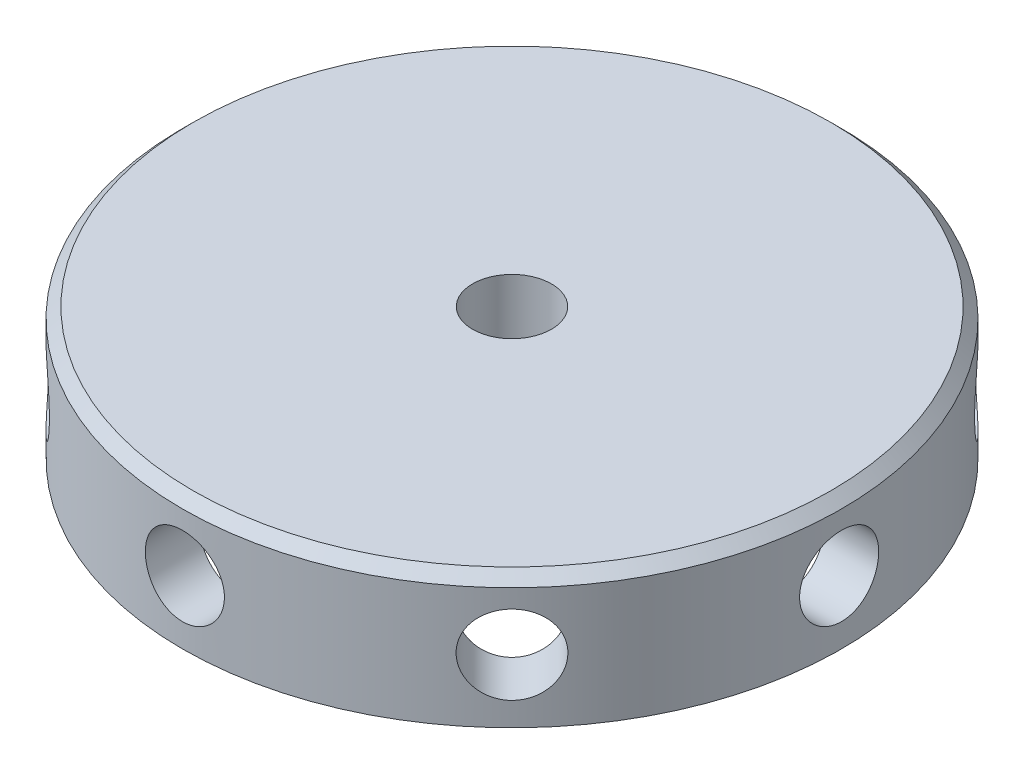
ISO-10303-21;
HEADER;
FILE_DESCRIPTION(('STEP AP214'),'2;1');
FILE_NAME('part.step','',(''),(''),'','','');
FILE_SCHEMA(('AUTOMOTIVE_DESIGN { 1 0 10303 214 1 1 1 1 }'));
ENDSEC;
DATA;
#1=APPLICATION_CONTEXT('core data for automotive mechanical design processes');
#2=APPLICATION_PROTOCOL_DEFINITION('international standard','automotive_design',2000,#1);
#3=PRODUCT_CONTEXT('',#1,'mechanical');
#4=PRODUCT('Part','Part','',(#3));
#5=PRODUCT_RELATED_PRODUCT_CATEGORY('part','',(#4));
#6=PRODUCT_DEFINITION_FORMATION('','',#4);
#7=PRODUCT_DEFINITION_CONTEXT('part definition',#1,'design');
#8=PRODUCT_DEFINITION('design','',#6,#7);
#9=PRODUCT_DEFINITION_SHAPE('','',#8);
#10=(LENGTH_UNIT() NAMED_UNIT(*) SI_UNIT(.MILLI.,.METRE.));
#11=(NAMED_UNIT(*) PLANE_ANGLE_UNIT() SI_UNIT($,.RADIAN.));
#12=(NAMED_UNIT(*) SI_UNIT($,.STERADIAN.) SOLID_ANGLE_UNIT());
#13=UNCERTAINTY_MEASURE_WITH_UNIT(LENGTH_MEASURE(1.E-05),#10,'distance_accuracy_value','');
#14=(GEOMETRIC_REPRESENTATION_CONTEXT(3) GLOBAL_UNCERTAINTY_ASSIGNED_CONTEXT((#13)) GLOBAL_UNIT_ASSIGNED_CONTEXT((#10,
#11,#12)) REPRESENTATION_CONTEXT('',''));
#15=CARTESIAN_POINT('',(0.,0.,0.));
#16=DIRECTION('',(0.,0.,1.));
#17=DIRECTION('',(1.,0.,0.));
#18=AXIS2_PLACEMENT_3D('',#15,#16,#17);
#19=CARTESIAN_POINT('',(0.,6.35,0.));
#20=DIRECTION('',(0.,-1.,0.));
#21=DIRECTION('',(0.,0.,-1.));
#22=AXIS2_PLACEMENT_3D('',#19,#20,#21);
#23=CYLINDRICAL_SURFACE('',#22,15.875);
#24=CARTESIAN_POINT('',(15.7602855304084,3.048,-1.90500000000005));
#25=CARTESIAN_POINT('',(15.7602870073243,2.94140944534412,-1.90499544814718));
#26=CARTESIAN_POINT('',(15.7613785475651,2.83475142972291,-1.8960237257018));
#27=CARTESIAN_POINT('',(15.7656253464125,2.62440127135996,-1.86037422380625));
#28=CARTESIAN_POINT('',(15.7687827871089,2.52071238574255,-1.83367772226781));
#29=CARTESIAN_POINT('',(15.7767987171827,2.31937661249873,-1.76337489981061));
#30=CARTESIAN_POINT('',(15.7816560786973,2.2217257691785,-1.71977978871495));
#31=CARTESIAN_POINT('',(15.7925231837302,2.03514506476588,-1.61694074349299));
#32=CARTESIAN_POINT('',(15.7985327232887,1.94621366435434,-1.55769957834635));
#33=CARTESIAN_POINT('',(15.8110618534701,1.77911774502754,-1.4249218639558));
#34=CARTESIAN_POINT('',(15.8175836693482,1.70100479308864,-1.35132062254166));
#35=CARTESIAN_POINT('',(15.8303824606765,1.55820826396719,-1.19205112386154));
#36=CARTESIAN_POINT('',(15.836659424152,1.49352534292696,-1.10638227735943));
#37=CARTESIAN_POINT('',(15.8482839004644,1.37924125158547,-0.92508677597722));
#38=CARTESIAN_POINT('',(15.8536285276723,1.32968656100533,-0.829430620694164));
#39=CARTESIAN_POINT('',(15.8627617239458,1.24736322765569,-0.631079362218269));
#40=CARTESIAN_POINT('',(15.8665503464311,1.21459400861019,-0.528384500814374));
#41=CARTESIAN_POINT('',(15.8721289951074,1.16692536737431,-0.319397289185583));
#42=CARTESIAN_POINT('',(15.8739285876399,1.15194038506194,-0.213124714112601));
#43=CARTESIAN_POINT('',(15.8753590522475,1.14000051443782,0.000441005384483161));
#44=CARTESIAN_POINT('',(15.8749900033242,1.14304496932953,0.10773411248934));
#45=CARTESIAN_POINT('',(15.8721325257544,1.16700879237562,0.319713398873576));
#46=CARTESIAN_POINT('',(15.8696550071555,1.18783614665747,0.424410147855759));
#47=CARTESIAN_POINT('',(15.8628712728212,1.24663082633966,0.628811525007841));
#48=CARTESIAN_POINT('',(15.8585650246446,1.28459845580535,0.728516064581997));
#49=CARTESIAN_POINT('',(15.8485889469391,1.37669443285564,0.920388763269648));
#50=CARTESIAN_POINT('',(15.842915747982,1.43086279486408,1.01253753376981));
#51=CARTESIAN_POINT('',(15.8308408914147,1.55379350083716,1.18647141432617));
#52=CARTESIAN_POINT('',(15.8244392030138,1.62255646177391,1.26825608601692));
#53=CARTESIAN_POINT('',(15.8115766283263,1.77324026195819,1.41968042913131));
#54=CARTESIAN_POINT('',(15.8051156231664,1.85524126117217,1.48924034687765));
#55=CARTESIAN_POINT('',(15.7929025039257,2.02979751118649,1.61362130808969));
#56=CARTESIAN_POINT('',(15.7871503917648,2.12235279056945,1.66844231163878));
#57=CARTESIAN_POINT('',(15.7770062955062,2.31545923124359,1.76179275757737));
#58=CARTESIAN_POINT('',(15.772614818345,2.41601335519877,1.80031612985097));
#59=CARTESIAN_POINT('',(15.7656992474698,2.62222764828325,1.85990871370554));
#60=CARTESIAN_POINT('',(15.7631750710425,2.72788759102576,1.88097869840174));
#61=CARTESIAN_POINT('',(15.7602948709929,2.9406107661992,1.90496144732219));
#62=CARTESIAN_POINT('',(15.7599254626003,3.04766118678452,1.90798630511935));
#63=CARTESIAN_POINT('',(15.7613612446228,3.26074327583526,1.89608839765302));
#64=CARTESIAN_POINT('',(15.7631663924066,3.36677496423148,1.88116598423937));
#65=CARTESIAN_POINT('',(15.7687356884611,3.57447582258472,1.83389137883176));
#66=CARTESIAN_POINT('',(15.7724937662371,3.67615746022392,1.8015931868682));
#67=CARTESIAN_POINT('',(15.7815405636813,3.87266134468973,1.72053933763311));
#68=CARTESIAN_POINT('',(15.786829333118,3.96748336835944,1.67178314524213));
#69=CARTESIAN_POINT('',(15.7983737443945,4.14808434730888,1.55892057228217));
#70=CARTESIAN_POINT('',(15.8046339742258,4.23381696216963,1.49474051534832));
#71=CARTESIAN_POINT('',(15.8174014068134,4.39333329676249,1.35295651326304));
#72=CARTESIAN_POINT('',(15.8239086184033,4.46711658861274,1.27535208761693));
#73=CARTESIAN_POINT('',(15.8364777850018,4.60103203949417,1.10843331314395));
#74=CARTESIAN_POINT('',(15.8425372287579,4.66109065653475,1.01905974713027));
#75=CARTESIAN_POINT('',(15.8534907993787,4.76534366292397,0.831428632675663));
#76=CARTESIAN_POINT('',(15.8583849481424,4.80953835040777,0.733171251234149));
#77=CARTESIAN_POINT('',(15.8664453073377,4.88068683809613,0.530808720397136));
#78=CARTESIAN_POINT('',(15.8696158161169,4.9076835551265,0.426718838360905));
#79=CARTESIAN_POINT('',(15.8738894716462,4.94380948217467,0.215443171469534));
#80=CARTESIAN_POINT('',(15.8749927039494,4.95293943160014,0.108257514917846));
#81=CARTESIAN_POINT('',(15.8750071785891,4.95305959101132,-0.105448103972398));
#82=CARTESIAN_POINT('',(15.8739321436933,4.94416336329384,-0.211968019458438));
#83=CARTESIAN_POINT('',(15.8697380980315,4.90872370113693,-0.421987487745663));
#84=CARTESIAN_POINT('',(15.8666190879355,4.88218027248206,-0.525487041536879));
#85=CARTESIAN_POINT('',(15.8586860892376,4.81223446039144,-0.72651591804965));
#86=CARTESIAN_POINT('',(15.853872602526,4.7688370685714,-0.824046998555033));
#87=CARTESIAN_POINT('',(15.8430844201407,4.6664269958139,-1.01045988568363));
#88=CARTESIAN_POINT('',(15.8371097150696,4.60741418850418,-1.09934162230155));
#89=CARTESIAN_POINT('',(15.8246215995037,4.47502681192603,-1.2665135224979));
#90=CARTESIAN_POINT('',(15.8181051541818,4.40156767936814,-1.34473649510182));
#91=CARTESIAN_POINT('',(15.8052926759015,4.24254737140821,-1.48779059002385));
#92=CARTESIAN_POINT('',(15.798996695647,4.15698332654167,-1.55261852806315));
#93=CARTESIAN_POINT('',(15.787314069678,3.97583473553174,-1.66723742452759));
#94=CARTESIAN_POINT('',(15.781930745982,3.88021555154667,-1.71697394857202));
#95=CARTESIAN_POINT('',(15.772721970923,3.68197272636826,-1.79961416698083));
#96=CARTESIAN_POINT('',(15.7688948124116,3.57935690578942,-1.83253631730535));
#97=CARTESIAN_POINT('',(15.7641688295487,3.40483219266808,-1.87265951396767));
#98=CARTESIAN_POINT('',(15.7627197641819,3.33402765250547,-1.88476994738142));
#99=CARTESIAN_POINT('',(15.760777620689,3.19149226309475,-1.90094169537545));
#100=CARTESIAN_POINT('',(15.7602845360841,3.11976142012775,-1.90500306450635));
#101=CARTESIAN_POINT('',(15.7602855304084,3.048,-1.90500000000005));
#102=B_SPLINE_CURVE_WITH_KNOTS('',3,(#24,#25,#26,#27,#28,#29,#30,#31,#32,#33,#34,#35,#36,#37,
#38,#39,#40,#41,#42,#43,#44,#45,#46,#47,#48,#49,#50,#51,#52,#53,#54,#55,#56,#57,#58,#59,#60,#61,
#62,#63,#64,#65,#66,#67,#68,#69,#70,#71,#72,#73,#74,#75,#76,#77,#78,#79,#80,#81,#82,#83,#84,#85,
#86,#87,#88,#89,#90,#91,#92,#93,#94,#95,#96,#97,#98,#99,#100,#101),.UNSPECIFIED.,.T.,.F.,(4,2,2,
2,2,2,2,2,2,2,2,2,2,2,2,2,2,2,2,2,2,2,2,2,2,2,2,2,2,2,2,2,2,2,2,2,2,2,4),(0.,0.319509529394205,
0.639357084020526,0.958992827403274,1.2785720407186,1.59962566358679,1.92069496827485,
2.24274101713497,2.56477600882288,2.88525532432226,3.20572296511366,3.52454239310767,
3.84336747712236,4.16298662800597,4.48261929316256,4.80426550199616,5.1259125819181,
5.44767935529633,5.76943187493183,6.08918361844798,6.40892909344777,6.72768656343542,
7.04645439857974,7.36677628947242,7.68710964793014,8.00912120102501,8.33112670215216,
8.65232547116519,8.97351094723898,9.29267929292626,9.61184753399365,9.93092131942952,
10.2499976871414,10.5710006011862,10.8920797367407,11.2143035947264,11.5361730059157,
11.7512822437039,11.9663900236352),.UNSPECIFIED.);
#103=CARTESIAN_POINT('',(15.7602855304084,3.048,-1.90500000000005));
#104=VERTEX_POINT('',#103);
#105=EDGE_CURVE('E75',#104,#104,#102,.T.);
#106=ORIENTED_EDGE('',*,*,#105,.T.);
#107=EDGE_LOOP('',(#106));
#108=FACE_BOUND('',#107,.T.);
#109=CARTESIAN_POINT('',(9.79716635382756,3.048,-12.4912431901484));
#110=CARTESIAN_POINT('',(9.79717061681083,2.94140944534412,-12.4912410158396));
#111=CARTESIAN_POINT('',(9.80428641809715,2.83475142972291,-12.4856688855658));
#112=CARTESIAN_POINT('',(9.8324973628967,2.62440127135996,-12.4634638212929));
#113=CARTESIAN_POINT('',(9.85360728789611,2.52071238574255,-12.4468191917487));
#114=CARTESIAN_POINT('',(9.90898700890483,2.31937661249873,-12.4027757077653));
#115=CARTESIAN_POINT('',(9.94324808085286,2.2217257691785,-12.3753839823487));
#116=CARTESIAN_POINT('',(10.0236504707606,2.03514506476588,-12.3103499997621));
#117=CARTESIAN_POINT('',(10.0697896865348,1.94621366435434,-12.2727095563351));
#118=CARTESIAN_POINT('',(10.1725371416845,1.77911774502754,-12.1876809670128));
#119=CARTESIAN_POINT('',(10.2291926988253,1.70100479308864,-12.1402486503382));
#120=CARTESIAN_POINT('',(10.3508633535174,1.55820826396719,-12.0366782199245));
#121=CARTESIAN_POINT('',(10.4158788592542,1.49352534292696,-11.9805396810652));
#122=CARTESIAN_POINT('',(10.5522938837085,1.37924125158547,-11.8605641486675));
#123=CARTESIAN_POINT('',(10.6237122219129,1.32968656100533,-11.7967042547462));
#124=CARTESIAN_POINT('',(10.7704258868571,1.24736322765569,-11.6629068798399));
#125=CARTESIAN_POINT('',(10.8457210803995,1.21459400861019,-11.592969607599));
#126=CARTESIAN_POINT('',(10.9974420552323,1.16692536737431,-11.4491380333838));
#127=CARTESIAN_POINT('',(11.0738606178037,1.15194038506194,-11.3752644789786));
#128=CARTESIAN_POINT('',(11.2258858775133,1.14000051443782,-11.2252622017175));
#129=CARTESIAN_POINT('',(11.3014926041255,1.14304496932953,-11.1491335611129));
#130=CARTESIAN_POINT('',(11.4493640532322,1.16700879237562,-10.9972210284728));
#131=CARTESIAN_POINT('',(11.5216439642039,1.18783614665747,-10.9214373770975));
#132=CARTESIAN_POINT('',(11.6613807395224,1.24663082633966,-10.7721069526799));
#133=CARTESIAN_POINT('',(11.7288375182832,1.28459845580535,-10.6985602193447));
#134=CARTESIAN_POINT('',(11.8574578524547,1.37669443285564,-10.555831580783));
#135=CARTESIAN_POINT('',(11.9186053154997,1.43086279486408,-10.4866610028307));
#136=CARTESIAN_POINT('',(12.0330569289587,1.55379350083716,-10.3551329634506));
#137=CARTESIAN_POINT('',(12.086360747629,1.62255646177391,-10.2927757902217));
#138=CARTESIAN_POINT('',(12.1843387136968,1.77324026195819,-10.1766073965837));
#139=CARTESIAN_POINT('',(12.2289563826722,1.85524126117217,-10.1228524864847));
#140=CARTESIAN_POINT('',(12.3082710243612,2.02979751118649,-10.0262658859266));
#141=CARTESIAN_POINT('',(12.3429679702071,2.12235279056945,-9.98343422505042));
#142=CARTESIAN_POINT('',(12.4018037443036,2.31545923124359,-9.91025253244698));
#143=CARTESIAN_POINT('',(12.4259386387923,2.41601335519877,-9.87990715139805));
#144=CARTESIAN_POINT('',(12.4631869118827,2.62222764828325,-9.83287878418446));
#145=CARTESIAN_POINT('',(12.4763007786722,2.72788759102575,-9.81619519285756));
#146=CARTESIAN_POINT('',(12.4912225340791,2.94061076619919,-9.79720021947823));
#147=CARTESIAN_POINT('',(12.4931002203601,3.04766118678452,-9.79480011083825));
#148=CARTESIAN_POINT('',(12.4857023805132,3.26074327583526,-9.80422845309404));
#149=CARTESIAN_POINT('',(12.4764270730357,3.36677496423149,-9.81605662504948));
#150=CARTESIAN_POINT('',(12.4469369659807,3.57447582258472,-9.85342290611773));
#151=CARTESIAN_POINT('',(12.4267560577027,3.67615746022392,-9.87891853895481));
#152=CARTESIAN_POINT('',(12.3758393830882,3.87266134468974,-9.94262931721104));
#153=CARTESIAN_POINT('',(12.3451032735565,3.96748336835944,-9.98084487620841));
#154=CARTESIAN_POINT('',(12.2734605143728,4.14808434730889,-10.0688138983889));
#155=CARTESIAN_POINT('',(12.2325050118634,4.23381696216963,-10.1186227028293));
#156=CARTESIAN_POINT('',(12.1412765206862,4.39333329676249,-10.2279070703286));
#157=CARTESIAN_POINT('',(12.0910031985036,4.46711658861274,-10.2873829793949));
#158=CARTESIAN_POINT('',(11.981861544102,4.60103203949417,-10.4143001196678));
#159=CARTESIAN_POINT('',(11.9229495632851,4.66109065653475,-10.481781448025));
#160=CARTESIAN_POINT('',(11.7980196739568,4.76534366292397,-10.6222020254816));
#161=CARTESIAN_POINT('',(11.7320018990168,4.80953835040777,-10.6951411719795));
#162=CARTESIAN_POINT('',(11.5946095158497,4.88068683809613,-10.8439326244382));
#163=CARTESIAN_POINT('',(11.5232487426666,4.9076835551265,-10.9197771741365));
#164=CARTESIAN_POINT('',(11.3768762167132,4.94380948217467,-11.0721935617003));
#165=CARTESIAN_POINT('',(11.3018646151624,4.95293943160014,-11.1487653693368));
#166=CARTESIAN_POINT('',(11.1507621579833,4.95305959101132,-11.2998882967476));
#167=CARTESIAN_POINT('',(11.0746810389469,4.94416336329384,-11.3744490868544));
#168=CARTESIAN_POINT('',(10.9232092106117,4.90872370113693,-11.5199896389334));
#169=CARTESIAN_POINT('',(10.8478185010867,4.88218027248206,-11.5909694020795));
#170=CARTESIAN_POINT('',(10.7000601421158,4.81223446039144,-11.7275088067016));
#171=CARTESIAN_POINT('',(10.627691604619,4.7688370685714,-11.7930700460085));
#172=CARTESIAN_POINT('',(10.4882493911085,4.6664269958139,-11.9172554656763));
#173=CARTESIAN_POINT('',(10.421175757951,4.60741418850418,-11.9758795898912));
#174=CARTESIAN_POINT('',(10.2941369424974,4.47502681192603,-12.0852575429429));
#175=CARTESIAN_POINT('',(10.2342171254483,4.40156767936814,-12.1359617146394));
#176=CARTESIAN_POINT('',(10.1240028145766,4.24254737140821,-12.2280564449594));
#177=CARTESIAN_POINT('',(10.0737106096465,4.15698332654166,-12.2694447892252));
#178=CARTESIAN_POINT('',(9.98440194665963,3.97583473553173,-12.3422317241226));
#179=CARTESIAN_POINT('',(9.94542632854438,3.88021555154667,-12.3735941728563));
#180=CARTESIAN_POINT('',(9.88047928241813,3.68197272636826,-12.4255180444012));
#181=CARTESIAN_POINT('',(9.85449359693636,3.57935690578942,-12.4460913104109));
#182=CARTESIAN_POINT('',(9.82278043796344,3.40483219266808,-12.4711209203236));
#183=CARTESIAN_POINT('',(9.81319242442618,3.33402765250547,-12.4786596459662));
#184=CARTESIAN_POINT('',(9.80038396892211,3.19149226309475,-12.4887214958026));
#185=CARTESIAN_POINT('',(9.7971634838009,3.11976142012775,-12.4912446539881));
#186=CARTESIAN_POINT('',(9.79716635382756,3.048,-12.4912431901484));
#187=B_SPLINE_CURVE_WITH_KNOTS('',3,(#109,#110,#111,#112,#113,#114,#115,#116,#117,#118,#119,
#120,#121,#122,#123,#124,#125,#126,#127,#128,#129,#130,#131,#132,#133,#134,#135,#136,#137,#138,
#139,#140,#141,#142,#143,#144,#145,#146,#147,#148,#149,#150,#151,#152,#153,#154,#155,#156,#157,
#158,#159,#160,#161,#162,#163,#164,#165,#166,#167,#168,#169,#170,#171,#172,#173,#174,#175,#176,
#177,#178,#179,#180,#181,#182,#183,#184,#185,#186),.UNSPECIFIED.,.T.,.F.,(4,2,2,2,2,2,2,2,2,2,2,
2,2,2,2,2,2,2,2,2,2,2,2,2,2,2,2,2,2,2,2,2,2,2,2,2,2,2,4),(0.,0.319509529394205,
0.639357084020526,0.958992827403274,1.2785720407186,1.59962566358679,1.92069496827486,
2.24274101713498,2.56477600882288,2.88525532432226,3.20572296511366,3.52454239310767,
3.84336747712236,4.16298662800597,4.48261929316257,4.80426550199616,5.1259125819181,
5.44767935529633,5.76943187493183,6.08918361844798,6.40892909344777,6.72768656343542,
7.04645439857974,7.36677628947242,7.68710964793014,8.00912120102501,8.33112670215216,
8.65232547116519,8.97351094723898,9.29267929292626,9.61184753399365,9.93092131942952,
10.2499976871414,10.5710006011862,10.8920797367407,11.2143035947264,11.5361730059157,
11.7512822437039,11.9663900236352),.UNSPECIFIED.);
#188=CARTESIAN_POINT('',(9.79716635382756,3.048,-12.4912431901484));
#189=VERTEX_POINT('',#188);
#190=EDGE_CURVE('E150',#189,#189,#187,.T.);
#191=ORIENTED_EDGE('',*,*,#190,.T.);
#192=EDGE_LOOP('',(#191));
#193=FACE_BOUND('',#192,.T.);
#194=CARTESIAN_POINT('',(0.,4.953,-15.875));
#195=CARTESIAN_POINT('',(-0.106593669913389,4.95299545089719,-15.8749985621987));
#196=CARTESIAN_POINT('',(-0.213254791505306,4.94402322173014,-15.8739150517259));
#197=CARTESIAN_POINT('',(-0.423611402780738,4.90837152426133,-15.869696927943));
#198=CARTESIAN_POINT('',(-0.527303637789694,4.88167334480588,-15.8665601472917));
#199=CARTESIAN_POINT('',(-0.728646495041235,4.81136561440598,-15.8585890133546));
#200=CARTESIAN_POINT('',(-0.826301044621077,4.76776719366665,-15.8537557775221));
#201=CARTESIAN_POINT('',(-1.01288796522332,4.6649203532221,-15.8429299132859));
#202=CARTESIAN_POINT('',(-1.10182188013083,4.60567471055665,-15.836937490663));
#203=CARTESIAN_POINT('',(-1.26891498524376,4.47289246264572,-15.8244286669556));
#204=CARTESIAN_POINT('',(-1.34702339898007,4.39929216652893,-15.8179100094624));
#205=CARTESIAN_POINT('',(-1.48981116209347,4.24002646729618,-15.8051017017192));
#206=CARTESIAN_POINT('',(-1.55448984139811,4.15436046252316,-15.7988120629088));
#207=CARTESIAN_POINT('',(-1.66876947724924,3.97306747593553,-15.7871515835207));
#208=CARTESIAN_POINT('',(-1.71832318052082,3.87741050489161,-15.7817836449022));
#209=CARTESIAN_POINT('',(-1.8006444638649,3.67905747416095,-15.7726037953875));
#210=CARTESIAN_POINT('',(-1.83341263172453,3.57636166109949,-15.7687918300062));
#211=CARTESIAN_POINT('',(-1.88107910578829,3.36737143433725,-15.7631768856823));
#212=CARTESIAN_POINT('',(-1.89606287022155,3.26109677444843,-15.7613643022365));
#213=CARTESIAN_POINT('',(-1.9079995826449,3.04752696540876,-15.7599238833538));
#214=CARTESIAN_POINT('',(-1.90495320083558,2.94023185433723,-15.7602959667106));
#215=CARTESIAN_POINT('',(-1.88098630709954,2.72826101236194,-15.7631740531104));
#216=CARTESIAN_POINT('',(-1.86015974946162,2.62357448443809,-15.7656688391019));
#217=CARTESIAN_POINT('',(-1.80137019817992,2.41919313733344,-15.7724937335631));
#218=CARTESIAN_POINT('',(-1.76340688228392,2.31949841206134,-15.7768238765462));
#219=CARTESIAN_POINT('',(-1.67131987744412,2.12763768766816,-15.7868443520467));
#220=CARTESIAN_POINT('',(-1.61715517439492,2.03549156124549,-15.7925381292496));
#221=CARTESIAN_POINT('',(-1.49423229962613,1.86156142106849,-15.8046416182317));
#222=CARTESIAN_POINT('',(-1.42547351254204,1.77977784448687,-15.8110513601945));
#223=CARTESIAN_POINT('',(-1.27479269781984,1.62834886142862,-15.8239144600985));
#224=CARTESIAN_POINT('',(-1.19278965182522,1.55878404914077,-15.8303678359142));
#225=CARTESIAN_POINT('',(-1.01822755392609,1.43439418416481,-15.8425528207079));
#226=CARTESIAN_POINT('',(-0.925668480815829,1.37956916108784,-15.8482844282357));
#227=CARTESIAN_POINT('',(-0.732560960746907,1.28621581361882,-15.8583832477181));
#228=CARTESIAN_POINT('',(-0.6320101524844,1.24769232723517,-15.8627500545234));
#229=CARTESIAN_POINT('',(-0.425803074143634,1.18809850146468,-15.8696234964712));
#230=CARTESIAN_POINT('',(-0.320147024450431,1.16702740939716,-15.8721302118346));
#231=CARTESIAN_POINT('',(-0.107425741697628,1.14304047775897,-15.8749906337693));
#232=CARTESIAN_POINT('',(-0.000373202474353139,1.14001357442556,-15.8753575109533));
#233=CARTESIAN_POINT('',(0.21271361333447,1.15190814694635,-15.8739324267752));
#234=CARTESIAN_POINT('',(0.318747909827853,1.16682927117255,-15.872140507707));
#235=CARTESIAN_POINT('',(0.526462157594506,1.21410410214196,-15.8666074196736));
#236=CARTESIAN_POINT('',(0.628154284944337,1.2464050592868,-15.8628721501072));
#237=CARTESIAN_POINT('',(0.824677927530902,1.32746794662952,-15.8538707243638));
#238=CARTESIAN_POINT('',(0.919509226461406,1.37623039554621,-15.8486045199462));
#239=CARTESIAN_POINT('',(1.1001166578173,1.48910225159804,-15.8370959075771));
#240=CARTESIAN_POINT('',(1.18584744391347,1.55328374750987,-15.8308489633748));
#241=CARTESIAN_POINT('',(1.34535941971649,1.69506953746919,-15.8180924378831));
#242=CARTESIAN_POINT('',(1.41914017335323,1.77267432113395,-15.8115828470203));
#243=CARTESIAN_POINT('',(1.55304994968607,1.93959201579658,-15.7989942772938));
#244=CARTESIAN_POINT('',(1.61310550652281,2.02896407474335,-15.792917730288));
#245=CARTESIAN_POINT('',(1.71735314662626,2.21659134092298,-15.7819226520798));
#246=CARTESIAN_POINT('',(1.76154552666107,2.31484638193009,-15.7770040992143));
#247=CARTESIAN_POINT('',(1.83269252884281,2.51721023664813,-15.7688982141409));
#248=CARTESIAN_POINT('',(1.85968906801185,2.62130413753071,-15.7657066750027));
#249=CARTESIAN_POINT('',(1.89581327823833,2.83258829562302,-15.7614039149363));
#250=CARTESIAN_POINT('',(1.90494171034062,2.9397784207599,-15.7602926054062));
#251=CARTESIAN_POINT('',(1.90505736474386,3.1534815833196,-15.7602785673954));
#252=CARTESIAN_POINT('',(1.89615999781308,3.25999457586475,-15.7613617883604));
#253=CARTESIAN_POINT('',(1.86072048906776,3.4699999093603,-15.7655846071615));
#254=CARTESIAN_POINT('',(1.83417834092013,3.5734922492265,-15.7687242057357));
#255=CARTESIAN_POINT('',(1.76423789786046,3.77450638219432,-15.7767017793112));
#256=CARTESIAN_POINT('',(1.72084470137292,3.87202997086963,-15.7815392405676));
#257=CARTESIAN_POINT('',(1.61844534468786,4.05842961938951,-15.7923683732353));
#258=CARTESIAN_POINT('',(1.55943904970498,4.14730560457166,-15.7983600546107));
#259=CARTESIAN_POINT('',(1.42705892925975,4.31447761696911,-15.8108685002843));
#260=CARTESIAN_POINT('',(1.35359904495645,4.39270527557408,-15.8173882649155));
#261=CARTESIAN_POINT('',(1.19457529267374,4.53576847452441,-15.8301915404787));
#262=CARTESIAN_POINT('',(1.10900856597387,4.60060084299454,-15.8364749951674));
#263=CARTESIAN_POINT('',(0.927857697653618,4.71522461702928,-15.8481218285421));
#264=CARTESIAN_POINT('',(0.832239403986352,4.76496235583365,-15.8534818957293));
#265=CARTESIAN_POINT('',(0.633998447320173,4.84760509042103,-15.8626440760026));
#266=CARTESIAN_POINT('',(0.531383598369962,4.88052852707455,-15.8664478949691));
#267=CARTESIAN_POINT('',(0.356855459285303,4.92065527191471,-15.8711435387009));
#268=CARTESIAN_POINT('',(0.286046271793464,4.93276730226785,-15.8725827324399));
#269=CARTESIAN_POINT('',(0.143501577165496,4.94894117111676,-15.8745114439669));
#270=CARTESIAN_POINT('',(0.0717660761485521,4.95300306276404,-15.8750009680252));
#271=CARTESIAN_POINT('',(0.,4.953,-15.875));
#272=B_SPLINE_CURVE_WITH_KNOTS('',3,(#194,#195,#196,#197,#198,#199,#200,#201,#202,#203,#204,
#205,#206,#207,#208,#209,#210,#211,#212,#213,#214,#215,#216,#217,#218,#219,#220,#221,#222,#223,
#224,#225,#226,#227,#228,#229,#230,#231,#232,#233,#234,#235,#236,#237,#238,#239,#240,#241,#242,
#243,#244,#245,#246,#247,#248,#249,#250,#251,#252,#253,#254,#255,#256,#257,#258,#259,#260,#261,
#262,#263,#264,#265,#266,#267,#268,#269,#270,#271),.UNSPECIFIED.,.T.,.F.,(4,2,2,2,2,2,2,2,2,2,2,
2,2,2,2,2,2,2,2,2,2,2,2,2,2,2,2,2,2,2,2,2,2,2,2,2,2,2,4),(0.,0.319518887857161,
0.639375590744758,0.959021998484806,1.27861171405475,1.59965308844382,1.92071047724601,
2.24276087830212,2.56480000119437,2.88528530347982,3.20575869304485,3.52454903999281,
3.84334538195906,4.1629556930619,4.48257948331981,4.80423819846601,5.12589755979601,
5.44765231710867,5.76939319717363,6.08915166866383,6.40890387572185,6.7276910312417,
7.04648823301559,7.36680595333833,7.68713535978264,8.00914118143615,8.33114097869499,
8.65235282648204,8.97355099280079,9.29269917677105,9.61184747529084,9.93089928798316,
10.2499538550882,10.570968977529,10.8920600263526,11.2142796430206,11.536145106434,
11.7512682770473,11.9663900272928),.UNSPECIFIED.);
#273=CARTESIAN_POINT('',(0.,4.953,-15.875));
#274=VERTEX_POINT('',#273);
#275=EDGE_CURVE('E145',#274,#274,#272,.T.);
#276=ORIENTED_EDGE('',*,*,#275,.T.);
#277=EDGE_LOOP('',(#276));
#278=FACE_BOUND('',#277,.T.);
#279=CARTESIAN_POINT('',(-12.4912431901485,3.048,-9.79716635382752));
#280=CARTESIAN_POINT('',(-12.4912410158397,2.94140944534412,-9.79717061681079));
#281=CARTESIAN_POINT('',(-12.4856688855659,2.83475142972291,-9.8042864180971));
#282=CARTESIAN_POINT('',(-12.4634638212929,2.62440127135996,-9.83249736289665));
#283=CARTESIAN_POINT('',(-12.4468191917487,2.52071238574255,-9.85360728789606));
#284=CARTESIAN_POINT('',(-12.4027757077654,2.31937661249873,-9.90898700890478));
#285=CARTESIAN_POINT('',(-12.3753839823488,2.2217257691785,-9.94324808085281));
#286=CARTESIAN_POINT('',(-12.3103499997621,2.03514506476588,-10.0236504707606));
#287=CARTESIAN_POINT('',(-12.2727095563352,1.94621366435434,-10.0697896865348));
#288=CARTESIAN_POINT('',(-12.1876809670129,1.77911774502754,-10.1725371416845));
#289=CARTESIAN_POINT('',(-12.1402486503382,1.70100479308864,-10.2291926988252));
#290=CARTESIAN_POINT('',(-12.0366782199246,1.55820826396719,-10.3508633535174));
#291=CARTESIAN_POINT('',(-11.9805396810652,1.49352534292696,-10.4158788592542));
#292=CARTESIAN_POINT('',(-11.8605641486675,1.37924125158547,-10.5522938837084));
#293=CARTESIAN_POINT('',(-11.7967042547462,1.32968656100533,-10.6237122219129));
#294=CARTESIAN_POINT('',(-11.66290687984,1.24736322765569,-10.770425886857));
#295=CARTESIAN_POINT('',(-11.592969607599,1.21459400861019,-10.8457210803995));
#296=CARTESIAN_POINT('',(-11.4491380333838,1.16692536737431,-10.9974420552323));
#297=CARTESIAN_POINT('',(-11.3752644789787,1.15194038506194,-11.0738606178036));
#298=CARTESIAN_POINT('',(-11.2252622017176,1.14000051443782,-11.2258858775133));
#299=CARTESIAN_POINT('',(-11.1491335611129,1.14304496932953,-11.3014926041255));
#300=CARTESIAN_POINT('',(-10.9972210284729,1.16700879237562,-11.4493640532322));
#301=CARTESIAN_POINT('',(-10.9214373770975,1.18783614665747,-11.5216439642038));
#302=CARTESIAN_POINT('',(-10.7721069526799,1.24663082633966,-11.6613807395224));
#303=CARTESIAN_POINT('',(-10.6985602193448,1.28459845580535,-11.7288375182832));
#304=CARTESIAN_POINT('',(-10.555831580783,1.37669443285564,-11.8574578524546));
#305=CARTESIAN_POINT('',(-10.4866610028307,1.43086279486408,-11.9186053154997));
#306=CARTESIAN_POINT('',(-10.3551329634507,1.55379350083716,-12.0330569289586));
#307=CARTESIAN_POINT('',(-10.2927757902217,1.62255646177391,-12.0863607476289));
#308=CARTESIAN_POINT('',(-10.1766073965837,1.77324026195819,-12.1843387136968));
#309=CARTESIAN_POINT('',(-10.1228524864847,1.85524126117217,-12.2289563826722));
#310=CARTESIAN_POINT('',(-10.0262658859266,2.02979751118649,-12.3082710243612));
#311=CARTESIAN_POINT('',(-9.98343422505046,2.12235279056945,-12.342967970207));
#312=CARTESIAN_POINT('',(-9.91025253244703,2.31545923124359,-12.4018037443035));
#313=CARTESIAN_POINT('',(-9.87990715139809,2.41601335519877,-12.4259386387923));
#314=CARTESIAN_POINT('',(-9.8328787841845,2.62222764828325,-12.4631869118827));
#315=CARTESIAN_POINT('',(-9.81619519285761,2.72788759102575,-12.4763007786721));
#316=CARTESIAN_POINT('',(-9.79720021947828,2.94061076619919,-12.4912225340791));
#317=CARTESIAN_POINT('',(-9.79480011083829,3.04766118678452,-12.4931002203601));
#318=CARTESIAN_POINT('',(-9.80422845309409,3.26074327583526,-12.4857023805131));
#319=CARTESIAN_POINT('',(-9.81605662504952,3.36677496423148,-12.4764270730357));
#320=CARTESIAN_POINT('',(-9.85342290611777,3.57447582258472,-12.4469369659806));
#321=CARTESIAN_POINT('',(-9.87891853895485,3.67615746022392,-12.4267560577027));
#322=CARTESIAN_POINT('',(-9.94262931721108,3.87266134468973,-12.3758393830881));
#323=CARTESIAN_POINT('',(-9.98084487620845,3.96748336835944,-12.3451032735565));
#324=CARTESIAN_POINT('',(-10.068813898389,4.14808434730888,-12.2734605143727));
#325=CARTESIAN_POINT('',(-10.1186227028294,4.23381696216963,-12.2325050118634));
#326=CARTESIAN_POINT('',(-10.2279070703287,4.39333329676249,-12.1412765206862));
#327=CARTESIAN_POINT('',(-10.287382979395,4.46711658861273,-12.0910031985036));
#328=CARTESIAN_POINT('',(-10.4143001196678,4.60103203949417,-11.981861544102));
#329=CARTESIAN_POINT('',(-10.4817814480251,4.66109065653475,-11.9229495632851));
#330=CARTESIAN_POINT('',(-10.6222020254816,4.76534366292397,-11.7980196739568));
#331=CARTESIAN_POINT('',(-10.6951411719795,4.80953835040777,-11.7320018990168));
#332=CARTESIAN_POINT('',(-10.8439326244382,4.88068683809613,-11.5946095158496));
#333=CARTESIAN_POINT('',(-10.9197771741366,4.9076835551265,-11.5232487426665));
#334=CARTESIAN_POINT('',(-11.0721935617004,4.94380948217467,-11.3768762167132));
#335=CARTESIAN_POINT('',(-11.1487653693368,4.95293943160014,-11.3018646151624));
#336=CARTESIAN_POINT('',(-11.2998882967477,4.95305959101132,-11.1507621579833));
#337=CARTESIAN_POINT('',(-11.3744490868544,4.94416336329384,-11.0746810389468));
#338=CARTESIAN_POINT('',(-11.5199896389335,4.90872370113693,-10.9232092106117));
#339=CARTESIAN_POINT('',(-11.5909694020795,4.88218027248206,-10.8478185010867));
#340=CARTESIAN_POINT('',(-11.7275088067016,4.81223446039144,-10.7000601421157));
#341=CARTESIAN_POINT('',(-11.7930700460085,4.7688370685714,-10.627691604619));
#342=CARTESIAN_POINT('',(-11.9172554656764,4.6664269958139,-10.4882493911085));
#343=CARTESIAN_POINT('',(-11.9758795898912,4.60741418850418,-10.421175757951));
#344=CARTESIAN_POINT('',(-12.085257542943,4.47502681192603,-10.2941369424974));
#345=CARTESIAN_POINT('',(-12.1359617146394,4.40156767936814,-10.2342171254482));
#346=CARTESIAN_POINT('',(-12.2280564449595,4.24254737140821,-10.1240028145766));
#347=CARTESIAN_POINT('',(-12.2694447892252,4.15698332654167,-10.0737106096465));
#348=CARTESIAN_POINT('',(-12.3422317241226,3.97583473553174,-9.98440194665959));
#349=CARTESIAN_POINT('',(-12.3735941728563,3.88021555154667,-9.94542632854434));
#350=CARTESIAN_POINT('',(-12.4255180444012,3.68197272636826,-9.88047928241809));
#351=CARTESIAN_POINT('',(-12.4460913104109,3.57935690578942,-9.85449359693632));
#352=CARTESIAN_POINT('',(-12.4711209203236,3.40483219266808,-9.8227804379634));
#353=CARTESIAN_POINT('',(-12.4786596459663,3.33402765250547,-9.81319242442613));
#354=CARTESIAN_POINT('',(-12.4887214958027,3.19149226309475,-9.80038396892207));
#355=CARTESIAN_POINT('',(-12.4912446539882,3.11976142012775,-9.79716348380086));
#356=CARTESIAN_POINT('',(-12.4912431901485,3.048,-9.79716635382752));
#357=B_SPLINE_CURVE_WITH_KNOTS('',3,(#279,#280,#281,#282,#283,#284,#285,#286,#287,#288,#289,
#290,#291,#292,#293,#294,#295,#296,#297,#298,#299,#300,#301,#302,#303,#304,#305,#306,#307,#308,
#309,#310,#311,#312,#313,#314,#315,#316,#317,#318,#319,#320,#321,#322,#323,#324,#325,#326,#327,
#328,#329,#330,#331,#332,#333,#334,#335,#336,#337,#338,#339,#340,#341,#342,#343,#344,#345,#346,
#347,#348,#349,#350,#351,#352,#353,#354,#355,#356),.UNSPECIFIED.,.T.,.F.,(4,2,2,2,2,2,2,2,2,2,2,
2,2,2,2,2,2,2,2,2,2,2,2,2,2,2,2,2,2,2,2,2,2,2,2,2,2,2,4),(0.,0.319509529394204,
0.639357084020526,0.958992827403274,1.2785720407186,1.59962566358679,1.92069496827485,
2.24274101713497,2.56477600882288,2.88525532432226,3.20572296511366,3.52454239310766,
3.84336747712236,4.16298662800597,4.48261929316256,4.80426550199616,5.1259125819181,
5.44767935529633,5.76943187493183,6.08918361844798,6.40892909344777,6.72768656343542,
7.04645439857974,7.36677628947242,7.68710964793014,8.00912120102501,8.33112670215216,
8.65232547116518,8.97351094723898,9.29267929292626,9.61184753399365,9.93092131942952,
10.2499976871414,10.5710006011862,10.8920797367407,11.2143035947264,11.5361730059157,
11.7512822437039,11.9663900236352),.UNSPECIFIED.);
#358=CARTESIAN_POINT('',(-12.4912431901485,3.048,-9.79716635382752));
#359=VERTEX_POINT('',#358);
#360=EDGE_CURVE('E140',#359,#359,#357,.T.);
#361=ORIENTED_EDGE('',*,*,#360,.T.);
#362=EDGE_LOOP('',(#361));
#363=FACE_BOUND('',#362,.T.);
#364=CARTESIAN_POINT('',(-15.7602855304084,3.048,1.90500000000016));
#365=CARTESIAN_POINT('',(-15.7602870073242,2.94140944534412,1.90499544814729));
#366=CARTESIAN_POINT('',(-15.7613785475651,2.83475142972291,1.89602372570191));
#367=CARTESIAN_POINT('',(-15.7656253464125,2.62440127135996,1.86037422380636));
#368=CARTESIAN_POINT('',(-15.7687827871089,2.52071238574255,1.83367772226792));
#369=CARTESIAN_POINT('',(-15.7767987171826,2.31937661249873,1.76337489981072));
#370=CARTESIAN_POINT('',(-15.7816560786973,2.2217257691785,1.71977978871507));
#371=CARTESIAN_POINT('',(-15.7925231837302,2.03514506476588,1.6169407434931));
#372=CARTESIAN_POINT('',(-15.7985327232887,1.94621366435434,1.55769957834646));
#373=CARTESIAN_POINT('',(-15.8110618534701,1.77911774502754,1.42492186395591));
#374=CARTESIAN_POINT('',(-15.8175836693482,1.70100479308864,1.35132062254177));
#375=CARTESIAN_POINT('',(-15.8303824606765,1.55820826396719,1.19205112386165));
#376=CARTESIAN_POINT('',(-15.836659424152,1.49352534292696,1.10638227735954));
#377=CARTESIAN_POINT('',(-15.8482839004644,1.37924125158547,0.925086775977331));
#378=CARTESIAN_POINT('',(-15.8536285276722,1.32968656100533,0.829430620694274));
#379=CARTESIAN_POINT('',(-15.8627617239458,1.24736322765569,0.631079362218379));
#380=CARTESIAN_POINT('',(-15.8665503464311,1.21459400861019,0.528384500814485));
#381=CARTESIAN_POINT('',(-15.8721289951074,1.16692536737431,0.319397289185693));
#382=CARTESIAN_POINT('',(-15.8739285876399,1.15194038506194,0.213124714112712));
#383=CARTESIAN_POINT('',(-15.8753590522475,1.14000051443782,-0.000441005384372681));
#384=CARTESIAN_POINT('',(-15.8749900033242,1.14304496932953,-0.107734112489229));
#385=CARTESIAN_POINT('',(-15.8721325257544,1.16700879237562,-0.319713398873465));
#386=CARTESIAN_POINT('',(-15.8696550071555,1.18783614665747,-0.424410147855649));
#387=CARTESIAN_POINT('',(-15.8628712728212,1.24663082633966,-0.628811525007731));
#388=CARTESIAN_POINT('',(-15.8585650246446,1.28459845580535,-0.728516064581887));
#389=CARTESIAN_POINT('',(-15.8485889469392,1.37669443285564,-0.920388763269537));
#390=CARTESIAN_POINT('',(-15.842915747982,1.43086279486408,-1.0125375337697));
#391=CARTESIAN_POINT('',(-15.8308408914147,1.55379350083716,-1.18647141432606));
#392=CARTESIAN_POINT('',(-15.8244392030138,1.62255646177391,-1.26825608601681));
#393=CARTESIAN_POINT('',(-15.8115766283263,1.77324026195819,-1.4196804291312));
#394=CARTESIAN_POINT('',(-15.8051156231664,1.85524126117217,-1.48924034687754));
#395=CARTESIAN_POINT('',(-15.7929025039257,2.02979751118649,-1.61362130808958));
#396=CARTESIAN_POINT('',(-15.7871503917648,2.12235279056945,-1.66844231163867));
#397=CARTESIAN_POINT('',(-15.7770062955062,2.31545923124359,-1.76179275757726));
#398=CARTESIAN_POINT('',(-15.772614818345,2.41601335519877,-1.80031612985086));
#399=CARTESIAN_POINT('',(-15.7656992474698,2.62222764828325,-1.85990871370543));
#400=CARTESIAN_POINT('',(-15.7631750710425,2.72788759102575,-1.88097869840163));
#401=CARTESIAN_POINT('',(-15.760294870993,2.9406107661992,-1.90496144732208));
#402=CARTESIAN_POINT('',(-15.7599254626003,3.04766118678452,-1.90798630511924));
#403=CARTESIAN_POINT('',(-15.7613612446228,3.26074327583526,-1.89608839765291));
#404=CARTESIAN_POINT('',(-15.7631663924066,3.36677496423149,-1.88116598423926));
#405=CARTESIAN_POINT('',(-15.7687356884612,3.57447582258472,-1.83389137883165));
#406=CARTESIAN_POINT('',(-15.7724937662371,3.67615746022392,-1.80159318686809));
#407=CARTESIAN_POINT('',(-15.7815405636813,3.87266134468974,-1.720539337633));
#408=CARTESIAN_POINT('',(-15.7868293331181,3.96748336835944,-1.67178314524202));
#409=CARTESIAN_POINT('',(-15.7983737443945,4.14808434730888,-1.55892057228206));
#410=CARTESIAN_POINT('',(-15.8046339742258,4.23381696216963,-1.49474051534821));
#411=CARTESIAN_POINT('',(-15.8174014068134,4.39333329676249,-1.35295651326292));
#412=CARTESIAN_POINT('',(-15.8239086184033,4.46711658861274,-1.27535208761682));
#413=CARTESIAN_POINT('',(-15.8364777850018,4.60103203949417,-1.10843331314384));
#414=CARTESIAN_POINT('',(-15.842537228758,4.66109065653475,-1.01905974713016));
#415=CARTESIAN_POINT('',(-15.8534907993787,4.76534366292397,-0.831428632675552));
#416=CARTESIAN_POINT('',(-15.8583849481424,4.80953835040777,-0.733171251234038));
#417=CARTESIAN_POINT('',(-15.8664453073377,4.88068683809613,-0.530808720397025));
#418=CARTESIAN_POINT('',(-15.8696158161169,4.9076835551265,-0.426718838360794));
#419=CARTESIAN_POINT('',(-15.8738894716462,4.94380948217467,-0.215443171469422));
#420=CARTESIAN_POINT('',(-15.8749927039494,4.95293943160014,-0.108257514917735));
#421=CARTESIAN_POINT('',(-15.8750071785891,4.95305959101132,0.10544810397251));
#422=CARTESIAN_POINT('',(-15.8739321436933,4.94416336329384,0.21196801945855));
#423=CARTESIAN_POINT('',(-15.8697380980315,4.90872370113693,0.421987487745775));
#424=CARTESIAN_POINT('',(-15.8666190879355,4.88218027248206,0.525487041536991));
#425=CARTESIAN_POINT('',(-15.8586860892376,4.81223446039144,0.726515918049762));
#426=CARTESIAN_POINT('',(-15.853872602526,4.7688370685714,0.824046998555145));
#427=CARTESIAN_POINT('',(-15.8430844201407,4.6664269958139,1.01045988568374));
#428=CARTESIAN_POINT('',(-15.8371097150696,4.60741418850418,1.09934162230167));
#429=CARTESIAN_POINT('',(-15.8246215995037,4.47502681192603,1.26651352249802));
#430=CARTESIAN_POINT('',(-15.8181051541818,4.40156767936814,1.34473649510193));
#431=CARTESIAN_POINT('',(-15.8052926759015,4.24254737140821,1.48779059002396));
#432=CARTESIAN_POINT('',(-15.798996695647,4.15698332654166,1.55261852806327));
#433=CARTESIAN_POINT('',(-15.787314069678,3.97583473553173,1.6672374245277));
#434=CARTESIAN_POINT('',(-15.781930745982,3.88021555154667,1.71697394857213));
#435=CARTESIAN_POINT('',(-15.772721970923,3.68197272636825,1.79961416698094));
#436=CARTESIAN_POINT('',(-15.7688948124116,3.57935690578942,1.83253631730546));
#437=CARTESIAN_POINT('',(-15.7641688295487,3.40483219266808,1.87265951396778));
#438=CARTESIAN_POINT('',(-15.7627197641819,3.33402765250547,1.88476994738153));
#439=CARTESIAN_POINT('',(-15.760777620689,3.19149226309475,1.90094169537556));
#440=CARTESIAN_POINT('',(-15.760284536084,3.11976142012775,1.90500306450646));
#441=CARTESIAN_POINT('',(-15.7602855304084,3.048,1.90500000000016));
#442=B_SPLINE_CURVE_WITH_KNOTS('',3,(#364,#365,#366,#367,#368,#369,#370,#371,#372,#373,#374,
#375,#376,#377,#378,#379,#380,#381,#382,#383,#384,#385,#386,#387,#388,#389,#390,#391,#392,#393,
#394,#395,#396,#397,#398,#399,#400,#401,#402,#403,#404,#405,#406,#407,#408,#409,#410,#411,#412,
#413,#414,#415,#416,#417,#418,#419,#420,#421,#422,#423,#424,#425,#426,#427,#428,#429,#430,#431,
#432,#433,#434,#435,#436,#437,#438,#439,#440,#441),.UNSPECIFIED.,.T.,.F.,(4,2,2,2,2,2,2,2,2,2,2,
2,2,2,2,2,2,2,2,2,2,2,2,2,2,2,2,2,2,2,2,2,2,2,2,2,2,2,4),(0.,0.319509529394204,
0.639357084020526,0.958992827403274,1.2785720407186,1.59962566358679,1.92069496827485,
2.24274101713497,2.56477600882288,2.88525532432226,3.20572296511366,3.52454239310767,
3.84336747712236,4.16298662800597,4.48261929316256,4.80426550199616,5.1259125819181,
5.44767935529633,5.76943187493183,6.08918361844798,6.40892909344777,6.72768656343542,
7.04645439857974,7.36677628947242,7.68710964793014,8.00912120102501,8.33112670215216,
8.65232547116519,8.97351094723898,9.29267929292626,9.61184753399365,9.93092131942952,
10.2499976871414,10.5710006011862,10.8920797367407,11.2143035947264,11.5361730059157,
11.7512822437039,11.9663900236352),.UNSPECIFIED.);
#443=CARTESIAN_POINT('',(-15.7602855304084,3.048,1.90500000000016));
#444=VERTEX_POINT('',#443);
#445=EDGE_CURVE('E133',#444,#444,#442,.T.);
#446=ORIENTED_EDGE('',*,*,#445,.T.);
#447=EDGE_LOOP('',(#446));
#448=FACE_BOUND('',#447,.T.);
#449=CARTESIAN_POINT('',(-9.79716635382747,3.048,12.4912431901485));
#450=CARTESIAN_POINT('',(-9.79717061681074,2.94140944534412,12.4912410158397));
#451=CARTESIAN_POINT('',(-9.80428641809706,2.83475142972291,12.4856688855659));
#452=CARTESIAN_POINT('',(-9.83249736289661,2.62440127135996,12.4634638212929));
#453=CARTESIAN_POINT('',(-9.85360728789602,2.52071238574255,12.4468191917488));
#454=CARTESIAN_POINT('',(-9.90898700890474,2.31937661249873,12.4027757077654));
#455=CARTESIAN_POINT('',(-9.94324808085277,2.2217257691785,12.3753839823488));
#456=CARTESIAN_POINT('',(-10.0236504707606,2.03514506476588,12.3103499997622));
#457=CARTESIAN_POINT('',(-10.0697896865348,1.94621366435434,12.2727095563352));
#458=CARTESIAN_POINT('',(-10.1725371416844,1.77911774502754,12.1876809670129));
#459=CARTESIAN_POINT('',(-10.2291926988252,1.70100479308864,12.1402486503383));
#460=CARTESIAN_POINT('',(-10.3508633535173,1.55820826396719,12.0366782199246));
#461=CARTESIAN_POINT('',(-10.4158788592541,1.49352534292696,11.9805396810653));
#462=CARTESIAN_POINT('',(-10.5522938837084,1.37924125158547,11.8605641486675));
#463=CARTESIAN_POINT('',(-10.6237122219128,1.32968656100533,11.7967042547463));
#464=CARTESIAN_POINT('',(-10.770425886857,1.24736322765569,11.66290687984));
#465=CARTESIAN_POINT('',(-10.8457210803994,1.21459400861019,11.592969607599));
#466=CARTESIAN_POINT('',(-10.9974420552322,1.16692536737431,11.4491380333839));
#467=CARTESIAN_POINT('',(-11.0738606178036,1.15194038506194,11.3752644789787));
#468=CARTESIAN_POINT('',(-11.2258858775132,1.14000051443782,11.2252622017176));
#469=CARTESIAN_POINT('',(-11.3014926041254,1.14304496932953,11.149133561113));
#470=CARTESIAN_POINT('',(-11.4493640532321,1.16700879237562,10.9972210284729));
#471=CARTESIAN_POINT('',(-11.5216439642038,1.18783614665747,10.9214373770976));
#472=CARTESIAN_POINT('',(-11.6613807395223,1.24663082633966,10.7721069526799));
#473=CARTESIAN_POINT('',(-11.7288375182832,1.28459845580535,10.6985602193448));
#474=CARTESIAN_POINT('',(-11.8574578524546,1.37669443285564,10.5558315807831));
#475=CARTESIAN_POINT('',(-11.9186053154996,1.43086279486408,10.4866610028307));
#476=CARTESIAN_POINT('',(-12.0330569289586,1.55379350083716,10.3551329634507));
#477=CARTESIAN_POINT('',(-12.0863607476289,1.62255646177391,10.2927757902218));
#478=CARTESIAN_POINT('',(-12.1843387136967,1.77324026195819,10.1766073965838));
#479=CARTESIAN_POINT('',(-12.2289563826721,1.85524126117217,10.1228524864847));
#480=CARTESIAN_POINT('',(-12.3082710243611,2.02979751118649,10.0262658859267));
#481=CARTESIAN_POINT('',(-12.342967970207,2.12235279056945,9.98343422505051));
#482=CARTESIAN_POINT('',(-12.4018037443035,2.31545923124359,9.91025253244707));
#483=CARTESIAN_POINT('',(-12.4259386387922,2.41601335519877,9.87990715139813));
#484=CARTESIAN_POINT('',(-12.4631869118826,2.62222764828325,9.83287878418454));
#485=CARTESIAN_POINT('',(-12.4763007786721,2.72788759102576,9.81619519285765));
#486=CARTESIAN_POINT('',(-12.4912225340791,2.9406107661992,9.79720021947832));
#487=CARTESIAN_POINT('',(-12.49310022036,3.04766118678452,9.79480011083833));
#488=CARTESIAN_POINT('',(-12.4857023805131,3.26074327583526,9.80422845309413));
#489=CARTESIAN_POINT('',(-12.4764270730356,3.36677496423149,9.81605662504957));
#490=CARTESIAN_POINT('',(-12.4469369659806,3.57447582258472,9.85342290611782));
#491=CARTESIAN_POINT('',(-12.4267560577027,3.67615746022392,9.8789185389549));
#492=CARTESIAN_POINT('',(-12.3758393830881,3.87266134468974,9.94262931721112));
#493=CARTESIAN_POINT('',(-12.3451032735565,3.96748336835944,9.98084487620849));
#494=CARTESIAN_POINT('',(-12.2734605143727,4.14808434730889,10.068813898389));
#495=CARTESIAN_POINT('',(-12.2325050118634,4.23381696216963,10.1186227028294));
#496=CARTESIAN_POINT('',(-12.1412765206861,4.39333329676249,10.2279070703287));
#497=CARTESIAN_POINT('',(-12.0910031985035,4.46711658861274,10.287382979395));
#498=CARTESIAN_POINT('',(-11.981861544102,4.60103203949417,10.4143001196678));
#499=CARTESIAN_POINT('',(-11.922949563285,4.66109065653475,10.4817814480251));
#500=CARTESIAN_POINT('',(-11.7980196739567,4.76534366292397,10.6222020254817));
#501=CARTESIAN_POINT('',(-11.7320018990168,4.80953835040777,10.6951411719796));
#502=CARTESIAN_POINT('',(-11.5946095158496,4.88068683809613,10.8439326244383));
#503=CARTESIAN_POINT('',(-11.5232487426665,4.9076835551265,10.9197771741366));
#504=CARTESIAN_POINT('',(-11.3768762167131,4.94380948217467,11.0721935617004));
#505=CARTESIAN_POINT('',(-11.3018646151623,4.95293943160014,11.1487653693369));
#506=CARTESIAN_POINT('',(-11.1507621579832,4.95305959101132,11.2998882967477));
#507=CARTESIAN_POINT('',(-11.0746810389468,4.94416336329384,11.3744490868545));
#508=CARTESIAN_POINT('',(-10.9232092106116,4.90872370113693,11.5199896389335));
#509=CARTESIAN_POINT('',(-10.8478185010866,4.88218027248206,11.5909694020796));
#510=CARTESIAN_POINT('',(-10.7000601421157,4.81223446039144,11.7275088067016));
#511=CARTESIAN_POINT('',(-10.627691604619,4.7688370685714,11.7930700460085));
#512=CARTESIAN_POINT('',(-10.4882493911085,4.6664269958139,11.9172554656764));
#513=CARTESIAN_POINT('',(-10.4211757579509,4.60741418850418,11.9758795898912));
#514=CARTESIAN_POINT('',(-10.2941369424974,4.47502681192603,12.085257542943));
#515=CARTESIAN_POINT('',(-10.2342171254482,4.40156767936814,12.1359617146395));
#516=CARTESIAN_POINT('',(-10.1240028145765,4.24254737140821,12.2280564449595));
#517=CARTESIAN_POINT('',(-10.0737106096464,4.15698332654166,12.2694447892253));
#518=CARTESIAN_POINT('',(-9.98440194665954,3.97583473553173,12.3422317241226));
#519=CARTESIAN_POINT('',(-9.9454263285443,3.88021555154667,12.3735941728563));
#520=CARTESIAN_POINT('',(-9.88047928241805,3.68197272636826,12.4255180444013));
#521=CARTESIAN_POINT('',(-9.85449359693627,3.57935690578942,12.4460913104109));
#522=CARTESIAN_POINT('',(-9.82278043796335,3.40483219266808,12.4711209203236));
#523=CARTESIAN_POINT('',(-9.81319242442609,3.33402765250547,12.4786596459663));
#524=CARTESIAN_POINT('',(-9.80038396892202,3.19149226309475,12.4887214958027));
#525=CARTESIAN_POINT('',(-9.79716348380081,3.11976142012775,12.4912446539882));
#526=CARTESIAN_POINT('',(-9.79716635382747,3.048,12.4912431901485));
#527=B_SPLINE_CURVE_WITH_KNOTS('',3,(#449,#450,#451,#452,#453,#454,#455,#456,#457,#458,#459,
#460,#461,#462,#463,#464,#465,#466,#467,#468,#469,#470,#471,#472,#473,#474,#475,#476,#477,#478,
#479,#480,#481,#482,#483,#484,#485,#486,#487,#488,#489,#490,#491,#492,#493,#494,#495,#496,#497,
#498,#499,#500,#501,#502,#503,#504,#505,#506,#507,#508,#509,#510,#511,#512,#513,#514,#515,#516,
#517,#518,#519,#520,#521,#522,#523,#524,#525,#526),.UNSPECIFIED.,.T.,.F.,(4,2,2,2,2,2,2,2,2,2,2,
2,2,2,2,2,2,2,2,2,2,2,2,2,2,2,2,2,2,2,2,2,2,2,2,2,2,2,4),(0.,0.319509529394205,
0.639357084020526,0.958992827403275,1.2785720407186,1.59962566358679,1.92069496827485,
2.24274101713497,2.56477600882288,2.88525532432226,3.20572296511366,3.52454239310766,
3.84336747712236,4.16298662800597,4.48261929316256,4.80426550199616,5.1259125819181,
5.44767935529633,5.76943187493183,6.08918361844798,6.40892909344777,6.72768656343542,
7.04645439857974,7.36677628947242,7.68710964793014,8.00912120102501,8.33112670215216,
8.65232547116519,8.97351094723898,9.29267929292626,9.61184753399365,9.93092131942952,
10.2499976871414,10.5710006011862,10.8920797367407,11.2143035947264,11.5361730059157,
11.7512822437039,11.9663900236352),.UNSPECIFIED.);
#528=CARTESIAN_POINT('',(-9.79716635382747,3.048,12.4912431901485));
#529=VERTEX_POINT('',#528);
#530=EDGE_CURVE('E126',#529,#529,#527,.T.);
#531=ORIENTED_EDGE('',*,*,#530,.T.);
#532=EDGE_LOOP('',(#531));
#533=FACE_BOUND('',#532,.T.);
#534=CARTESIAN_POINT('',(12.4912431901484,3.048,9.7971663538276));
#535=CARTESIAN_POINT('',(12.4912410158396,2.94140944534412,9.79717061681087));
#536=CARTESIAN_POINT('',(12.4856688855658,2.83475142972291,9.80428641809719));
#537=CARTESIAN_POINT('',(12.4634638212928,2.62440127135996,9.83249736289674));
#538=CARTESIAN_POINT('',(12.4468191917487,2.52071238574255,9.85360728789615));
#539=CARTESIAN_POINT('',(12.4027757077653,2.31937661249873,9.90898700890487));
#540=CARTESIAN_POINT('',(12.3753839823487,2.2217257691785,9.9432480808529));
#541=CARTESIAN_POINT('',(12.3103499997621,2.03514506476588,10.0236504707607));
#542=CARTESIAN_POINT('',(12.2727095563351,1.94621366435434,10.0697896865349));
#543=CARTESIAN_POINT('',(12.1876809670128,1.77911774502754,10.1725371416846));
#544=CARTESIAN_POINT('',(12.1402486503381,1.70100479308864,10.2291926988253));
#545=CARTESIAN_POINT('',(12.0366782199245,1.55820826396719,10.3508633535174));
#546=CARTESIAN_POINT('',(11.9805396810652,1.49352534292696,10.4158788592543));
#547=CARTESIAN_POINT('',(11.8605641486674,1.37924125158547,10.5522938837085));
#548=CARTESIAN_POINT('',(11.7967042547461,1.32968656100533,10.623712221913));
#549=CARTESIAN_POINT('',(11.6629068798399,1.24736322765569,10.7704258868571));
#550=CARTESIAN_POINT('',(11.5929696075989,1.21459400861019,10.8457210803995));
#551=CARTESIAN_POINT('',(11.4491380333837,1.16692536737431,10.9974420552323));
#552=CARTESIAN_POINT('',(11.3752644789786,1.15194038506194,11.0738606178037));
#553=CARTESIAN_POINT('',(11.2252622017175,1.14000051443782,11.2258858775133));
#554=CARTESIAN_POINT('',(11.1491335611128,1.14304496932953,11.3014926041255));
#555=CARTESIAN_POINT('',(10.9972210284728,1.16700879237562,11.4493640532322));
#556=CARTESIAN_POINT('',(10.9214373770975,1.18783614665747,11.5216439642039));
#557=CARTESIAN_POINT('',(10.7721069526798,1.24663082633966,11.6613807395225));
#558=CARTESIAN_POINT('',(10.6985602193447,1.28459845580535,11.7288375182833));
#559=CARTESIAN_POINT('',(10.5558315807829,1.37669443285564,11.8574578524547));
#560=CARTESIAN_POINT('',(10.4866610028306,1.43086279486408,11.9186053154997));
#561=CARTESIAN_POINT('',(10.3551329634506,1.55379350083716,12.0330569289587));
#562=CARTESIAN_POINT('',(10.2927757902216,1.62255646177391,12.086360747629));
#563=CARTESIAN_POINT('',(10.1766073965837,1.77324026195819,12.1843387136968));
#564=CARTESIAN_POINT('',(10.1228524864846,1.85524126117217,12.2289563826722));
#565=CARTESIAN_POINT('',(10.0262658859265,2.02979751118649,12.3082710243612));
#566=CARTESIAN_POINT('',(9.98343422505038,2.12235279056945,12.3429679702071));
#567=CARTESIAN_POINT('',(9.91025253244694,2.31545923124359,12.4018037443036));
#568=CARTESIAN_POINT('',(9.879907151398,2.41601335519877,12.4259386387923));
#569=CARTESIAN_POINT('',(9.83287878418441,2.62222764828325,12.4631869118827));
#570=CARTESIAN_POINT('',(9.81619519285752,2.72788759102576,12.4763007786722));
#571=CARTESIAN_POINT('',(9.79720021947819,2.9406107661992,12.4912225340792));
#572=CARTESIAN_POINT('',(9.7948001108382,3.04766118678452,12.4931002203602));
#573=CARTESIAN_POINT('',(9.804228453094,3.26074327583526,12.4857023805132));
#574=CARTESIAN_POINT('',(9.81605662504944,3.36677496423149,12.4764270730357));
#575=CARTESIAN_POINT('',(9.85342290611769,3.57447582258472,12.4469369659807));
#576=CARTESIAN_POINT('',(9.87891853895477,3.67615746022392,12.4267560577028));
#577=CARTESIAN_POINT('',(9.942629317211,3.87266134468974,12.3758393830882));
#578=CARTESIAN_POINT('',(9.98084487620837,3.96748336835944,12.3451032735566));
#579=CARTESIAN_POINT('',(10.0688138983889,4.14808434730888,12.2734605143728));
#580=CARTESIAN_POINT('',(10.1186227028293,4.23381696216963,12.2325050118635));
#581=CARTESIAN_POINT('',(10.2279070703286,4.39333329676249,12.1412765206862));
#582=CARTESIAN_POINT('',(10.2873829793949,4.46711658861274,12.0910031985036));
#583=CARTESIAN_POINT('',(10.4143001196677,4.60103203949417,11.9818615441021));
#584=CARTESIAN_POINT('',(10.481781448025,4.66109065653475,11.9229495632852));
#585=CARTESIAN_POINT('',(10.6222020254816,4.76534366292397,11.7980196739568));
#586=CARTESIAN_POINT('',(10.6951411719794,4.80953835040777,11.7320018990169));
#587=CARTESIAN_POINT('',(10.8439326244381,4.88068683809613,11.5946095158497));
#588=CARTESIAN_POINT('',(10.9197771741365,4.9076835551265,11.5232487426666));
#589=CARTESIAN_POINT('',(11.0721935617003,4.94380948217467,11.3768762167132));
#590=CARTESIAN_POINT('',(11.1487653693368,4.95293943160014,11.3018646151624));
#591=CARTESIAN_POINT('',(11.2998882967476,4.95305959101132,11.1507621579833));
#592=CARTESIAN_POINT('',(11.3744490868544,4.94416336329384,11.0746810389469));
#593=CARTESIAN_POINT('',(11.5199896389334,4.90872370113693,10.9232092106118));
#594=CARTESIAN_POINT('',(11.5909694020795,4.88218027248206,10.8478185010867));
#595=CARTESIAN_POINT('',(11.7275088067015,4.81223446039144,10.7000601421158));
#596=CARTESIAN_POINT('',(11.7930700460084,4.7688370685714,10.6276916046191));
#597=CARTESIAN_POINT('',(11.9172554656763,4.6664269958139,10.4882493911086));
#598=CARTESIAN_POINT('',(11.9758795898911,4.60741418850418,10.4211757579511));
#599=CARTESIAN_POINT('',(12.0852575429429,4.47502681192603,10.2941369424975));
#600=CARTESIAN_POINT('',(12.1359617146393,4.40156767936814,10.2342171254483));
#601=CARTESIAN_POINT('',(12.2280564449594,4.24254737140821,10.1240028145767));
#602=CARTESIAN_POINT('',(12.2694447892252,4.15698332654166,10.0737106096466));
#603=CARTESIAN_POINT('',(12.3422317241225,3.97583473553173,9.98440194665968));
#604=CARTESIAN_POINT('',(12.3735941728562,3.88021555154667,9.94542632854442));
#605=CARTESIAN_POINT('',(12.4255180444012,3.68197272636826,9.88047928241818));
#606=CARTESIAN_POINT('',(12.4460913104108,3.57935690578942,9.8544935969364));
#607=CARTESIAN_POINT('',(12.4711209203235,3.40483219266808,9.82278043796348));
#608=CARTESIAN_POINT('',(12.4786596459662,3.33402765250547,9.81319242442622));
#609=CARTESIAN_POINT('',(12.4887214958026,3.19149226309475,9.80038396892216));
#610=CARTESIAN_POINT('',(12.4912446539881,3.11976142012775,9.79716348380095));
#611=CARTESIAN_POINT('',(12.4912431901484,3.048,9.7971663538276));
#612=B_SPLINE_CURVE_WITH_KNOTS('',3,(#534,#535,#536,#537,#538,#539,#540,#541,#542,#543,#544,
#545,#546,#547,#548,#549,#550,#551,#552,#553,#554,#555,#556,#557,#558,#559,#560,#561,#562,#563,
#564,#565,#566,#567,#568,#569,#570,#571,#572,#573,#574,#575,#576,#577,#578,#579,#580,#581,#582,
#583,#584,#585,#586,#587,#588,#589,#590,#591,#592,#593,#594,#595,#596,#597,#598,#599,#600,#601,
#602,#603,#604,#605,#606,#607,#608,#609,#610,#611),.UNSPECIFIED.,.T.,.F.,(4,2,2,2,2,2,2,2,2,2,2,
2,2,2,2,2,2,2,2,2,2,2,2,2,2,2,2,2,2,2,2,2,2,2,2,2,2,2,4),(0.,0.319509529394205,
0.639357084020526,0.958992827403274,1.2785720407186,1.59962566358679,1.92069496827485,
2.24274101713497,2.56477600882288,2.88525532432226,3.20572296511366,3.52454239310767,
3.84336747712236,4.16298662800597,4.48261929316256,4.80426550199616,5.1259125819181,
5.44767935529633,5.76943187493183,6.08918361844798,6.40892909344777,6.72768656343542,
7.04645439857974,7.36677628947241,7.68710964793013,8.00912120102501,8.33112670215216,
8.65232547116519,8.97351094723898,9.29267929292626,9.61184753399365,9.93092131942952,
10.2499976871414,10.5710006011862,10.8920797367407,11.2143035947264,11.5361730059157,
11.7512822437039,11.9663900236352),.UNSPECIFIED.);
#613=CARTESIAN_POINT('',(12.4912431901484,3.048,9.7971663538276));
#614=VERTEX_POINT('',#613);
#615=EDGE_CURVE('E120',#614,#614,#612,.T.);
#616=ORIENTED_EDGE('',*,*,#615,.T.);
#617=EDGE_LOOP('',(#616));
#618=FACE_BOUND('',#617,.T.);
#619=CARTESIAN_POINT('',(1.905,3.048,15.7602855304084));
#620=CARTESIAN_POINT('',(1.90499544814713,2.94140944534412,15.7602870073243));
#621=CARTESIAN_POINT('',(1.89602372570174,2.83475142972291,15.7613785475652));
#622=CARTESIAN_POINT('',(1.8603742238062,2.62440127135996,15.7656253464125));
#623=CARTESIAN_POINT('',(1.83367772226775,2.52071238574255,15.7687827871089));
#624=CARTESIAN_POINT('',(1.76337489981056,2.31937661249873,15.7767987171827));
#625=CARTESIAN_POINT('',(1.7197797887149,2.2217257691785,15.7816560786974));
#626=CARTESIAN_POINT('',(1.61694074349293,2.03514506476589,15.7925231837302));
#627=CARTESIAN_POINT('',(1.55769957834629,1.94621366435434,15.7985327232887));
#628=CARTESIAN_POINT('',(1.42492186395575,1.77911774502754,15.8110618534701));
#629=CARTESIAN_POINT('',(1.3513206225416,1.70100479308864,15.8175836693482));
#630=CARTESIAN_POINT('',(1.19205112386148,1.55820826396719,15.8303824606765));
#631=CARTESIAN_POINT('',(1.10638227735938,1.49352534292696,15.836659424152));
#632=CARTESIAN_POINT('',(0.925086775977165,1.37924125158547,15.8482839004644));
#633=CARTESIAN_POINT('',(0.829430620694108,1.32968656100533,15.8536285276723));
#634=CARTESIAN_POINT('',(0.631079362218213,1.24736322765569,15.8627617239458));
#635=CARTESIAN_POINT('',(0.528384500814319,1.21459400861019,15.8665503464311));
#636=CARTESIAN_POINT('',(0.319397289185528,1.16692536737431,15.8721289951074));
#637=CARTESIAN_POINT('',(0.213124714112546,1.15194038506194,15.8739285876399));
#638=CARTESIAN_POINT('',(-0.00044100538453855,1.14000051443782,15.8753590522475));
#639=CARTESIAN_POINT('',(-0.107734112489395,1.14304496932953,15.8749900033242));
#640=CARTESIAN_POINT('',(-0.319713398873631,1.16700879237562,15.8721325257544));
#641=CARTESIAN_POINT('',(-0.424410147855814,1.18783614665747,15.8696550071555));
#642=CARTESIAN_POINT('',(-0.628811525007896,1.24663082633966,15.8628712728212));
#643=CARTESIAN_POINT('',(-0.728516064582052,1.28459845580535,15.8585650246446));
#644=CARTESIAN_POINT('',(-0.920388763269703,1.37669443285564,15.8485889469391));
#645=CARTESIAN_POINT('',(-1.01253753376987,1.43086279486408,15.8429157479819));
#646=CARTESIAN_POINT('',(-1.18647141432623,1.55379350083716,15.8308408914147));
#647=CARTESIAN_POINT('',(-1.26825608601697,1.62255646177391,15.8244392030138));
#648=CARTESIAN_POINT('',(-1.41968042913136,1.77324026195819,15.8115766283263));
#649=CARTESIAN_POINT('',(-1.4892403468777,1.85524126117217,15.8051156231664));
#650=CARTESIAN_POINT('',(-1.61362130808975,2.02979751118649,15.7929025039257));
#651=CARTESIAN_POINT('',(-1.66844231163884,2.12235279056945,15.7871503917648));
#652=CARTESIAN_POINT('',(-1.76179275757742,2.31545923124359,15.7770062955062));
#653=CARTESIAN_POINT('',(-1.80031612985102,2.41601335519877,15.772614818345));
#654=CARTESIAN_POINT('',(-1.8599087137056,2.62222764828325,15.7656992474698));
#655=CARTESIAN_POINT('',(-1.8809786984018,2.72788759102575,15.7631750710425));
#656=CARTESIAN_POINT('',(-1.90496144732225,2.9406107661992,15.7602948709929));
#657=CARTESIAN_POINT('',(-1.9079863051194,3.04766118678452,15.7599254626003));
#658=CARTESIAN_POINT('',(-1.89608839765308,3.26074327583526,15.7613612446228));
#659=CARTESIAN_POINT('',(-1.88116598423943,3.36677496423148,15.7631663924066));
#660=CARTESIAN_POINT('',(-1.83389137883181,3.57447582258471,15.7687356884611));
#661=CARTESIAN_POINT('',(-1.80159318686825,3.67615746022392,15.7724937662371));
#662=CARTESIAN_POINT('',(-1.72053933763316,3.87266134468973,15.7815405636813));
#663=CARTESIAN_POINT('',(-1.67178314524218,3.96748336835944,15.786829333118));
#664=CARTESIAN_POINT('',(-1.55892057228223,4.14808434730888,15.7983737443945));
#665=CARTESIAN_POINT('',(-1.49474051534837,4.23381696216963,15.8046339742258));
#666=CARTESIAN_POINT('',(-1.35295651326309,4.39333329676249,15.8174014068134));
#667=CARTESIAN_POINT('',(-1.27535208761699,4.46711658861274,15.8239086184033));
#668=CARTESIAN_POINT('',(-1.108433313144,4.60103203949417,15.8364777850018));
#669=CARTESIAN_POINT('',(-1.01905974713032,4.66109065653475,15.8425372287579));
#670=CARTESIAN_POINT('',(-0.831428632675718,4.76534366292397,15.8534907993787));
#671=CARTESIAN_POINT('',(-0.733171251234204,4.80953835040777,15.8583849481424));
#672=CARTESIAN_POINT('',(-0.530808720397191,4.88068683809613,15.8664453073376));
#673=CARTESIAN_POINT('',(-0.426718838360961,4.9076835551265,15.8696158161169));
#674=CARTESIAN_POINT('',(-0.215443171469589,4.94380948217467,15.8738894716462));
#675=CARTESIAN_POINT('',(-0.108257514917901,4.95293943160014,15.8749927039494));
#676=CARTESIAN_POINT('',(0.105448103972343,4.95305959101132,15.8750071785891));
#677=CARTESIAN_POINT('',(0.211968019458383,4.94416336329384,15.8739321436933));
#678=CARTESIAN_POINT('',(0.421987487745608,4.90872370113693,15.8697380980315));
#679=CARTESIAN_POINT('',(0.525487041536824,4.88218027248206,15.8666190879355));
#680=CARTESIAN_POINT('',(0.726515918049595,4.81223446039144,15.8586860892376));
#681=CARTESIAN_POINT('',(0.824046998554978,4.7688370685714,15.853872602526));
#682=CARTESIAN_POINT('',(1.01045988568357,4.6664269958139,15.8430844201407));
#683=CARTESIAN_POINT('',(1.0993416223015,4.60741418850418,15.8371097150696));
#684=CARTESIAN_POINT('',(1.26651352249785,4.47502681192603,15.8246215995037));
#685=CARTESIAN_POINT('',(1.34473649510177,4.40156767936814,15.8181051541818));
#686=CARTESIAN_POINT('',(1.48779059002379,4.24254737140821,15.8052926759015));
#687=CARTESIAN_POINT('',(1.5526185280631,4.15698332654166,15.798996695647));
#688=CARTESIAN_POINT('',(1.66723742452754,3.97583473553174,15.787314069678));
#689=CARTESIAN_POINT('',(1.71697394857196,3.88021555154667,15.781930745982));
#690=CARTESIAN_POINT('',(1.79961416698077,3.68197272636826,15.772721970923));
#691=CARTESIAN_POINT('',(1.83253631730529,3.57935690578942,15.7688948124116));
#692=CARTESIAN_POINT('',(1.87265951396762,3.40483219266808,15.7641688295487));
#693=CARTESIAN_POINT('',(1.88476994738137,3.33402765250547,15.7627197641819));
#694=CARTESIAN_POINT('',(1.9009416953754,3.19149226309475,15.760777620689));
#695=CARTESIAN_POINT('',(1.9050030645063,3.11976142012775,15.7602845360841));
#696=CARTESIAN_POINT('',(1.905,3.048,15.7602855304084));
#697=B_SPLINE_CURVE_WITH_KNOTS('',3,(#619,#620,#621,#622,#623,#624,#625,#626,#627,#628,#629,
#630,#631,#632,#633,#634,#635,#636,#637,#638,#639,#640,#641,#642,#643,#644,#645,#646,#647,#648,
#649,#650,#651,#652,#653,#654,#655,#656,#657,#658,#659,#660,#661,#662,#663,#664,#665,#666,#667,
#668,#669,#670,#671,#672,#673,#674,#675,#676,#677,#678,#679,#680,#681,#682,#683,#684,#685,#686,
#687,#688,#689,#690,#691,#692,#693,#694,#695,#696),.UNSPECIFIED.,.T.,.F.,(4,2,2,2,2,2,2,2,2,2,2,
2,2,2,2,2,2,2,2,2,2,2,2,2,2,2,2,2,2,2,2,2,2,2,2,2,2,2,4),(0.,0.319509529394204,
0.639357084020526,0.958992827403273,1.2785720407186,1.59962566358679,1.92069496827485,
2.24274101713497,2.56477600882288,2.88525532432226,3.20572296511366,3.52454239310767,
3.84336747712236,4.16298662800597,4.48261929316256,4.80426550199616,5.1259125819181,
5.44767935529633,5.76943187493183,6.08918361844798,6.40892909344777,6.72768656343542,
7.04645439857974,7.36677628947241,7.68710964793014,8.00912120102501,8.33112670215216,
8.65232547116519,8.97351094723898,9.29267929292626,9.61184753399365,9.93092131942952,
10.2499976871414,10.5710006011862,10.8920797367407,11.2143035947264,11.5361730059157,
11.7512822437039,11.9663900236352),.UNSPECIFIED.);
#698=CARTESIAN_POINT('',(1.905,3.048,15.7602855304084));
#699=VERTEX_POINT('',#698);
#700=EDGE_CURVE('E74',#699,#699,#697,.T.);
#701=ORIENTED_EDGE('',*,*,#700,.T.);
#702=EDGE_LOOP('',(#701));
#703=FACE_BOUND('',#702,.T.);
#704=CARTESIAN_POINT('',(0.,5.84199999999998,0.));
#705=DIRECTION('',(0.,1.,0.));
#706=DIRECTION('',(0.,0.,1.));
#707=AXIS2_PLACEMENT_3D('',#704,#705,#706);
#708=CIRCLE('',#707,15.875);
#709=CARTESIAN_POINT('',(0.,5.84199999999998,15.875));
#710=VERTEX_POINT('',#709);
#711=EDGE_CURVE('E10',#710,#710,#708,.F.);
#712=ORIENTED_EDGE('',*,*,#711,.T.);
#713=EDGE_LOOP('',(#712));
#714=FACE_BOUND('',#713,.T.);
#715=CARTESIAN_POINT('',(0.,0.,0.));
#716=DIRECTION('',(0.,1.,0.));
#717=DIRECTION('',(0.,0.,1.));
#718=AXIS2_PLACEMENT_3D('',#715,#716,#717);
#719=CIRCLE('',#718,15.875);
#720=CARTESIAN_POINT('',(0.,0.,15.875));
#721=VERTEX_POINT('',#720);
#722=EDGE_CURVE('E58',#721,#721,#719,.T.);
#723=ORIENTED_EDGE('',*,*,#722,.T.);
#724=EDGE_LOOP('',(#723));
#725=FACE_BOUND('',#724,.T.);
#726=ADVANCED_FACE('F39',(#108,#193,#278,#363,#448,#533,#618,#703,#714,#725),#23,.T.);
#727=CARTESIAN_POINT('',(0.,6.35,0.));
#728=DIRECTION('',(0.,1.,0.));
#729=DIRECTION('',(0.,0.,1.));
#730=AXIS2_PLACEMENT_3D('',#727,#728,#729);
#731=PLANE('',#730);
#732=CARTESIAN_POINT('',(0.,6.35,0.));
#733=DIRECTION('',(0.,1.,0.));
#734=DIRECTION('',(0.,0.,1.));
#735=AXIS2_PLACEMENT_3D('',#732,#733,#734);
#736=CIRCLE('',#735,1.89865);
#737=CARTESIAN_POINT('',(0.,6.35,1.89865));
#738=VERTEX_POINT('',#737);
#739=EDGE_CURVE('E66',#738,#738,#736,.T.);
#740=ORIENTED_EDGE('',*,*,#739,.F.);
#741=EDGE_LOOP('',(#740));
#742=FACE_BOUND('',#741,.T.);
#743=CARTESIAN_POINT('',(0.,6.35,0.));
#744=DIRECTION('',(0.,1.,0.));
#745=DIRECTION('',(0.,0.,1.));
#746=AXIS2_PLACEMENT_3D('',#743,#744,#745);
#747=CIRCLE('',#746,15.367);
#748=CARTESIAN_POINT('',(0.,6.35,15.367));
#749=VERTEX_POINT('',#748);
#750=EDGE_CURVE('E53',#749,#749,#747,.T.);
#751=ORIENTED_EDGE('',*,*,#750,.T.);
#752=EDGE_LOOP('',(#751));
#753=FACE_BOUND('',#752,.T.);
#754=ADVANCED_FACE('F112',(#742,#753),#731,.T.);
#755=CARTESIAN_POINT('',(0.,0.,0.));
#756=DIRECTION('',(0.,1.,0.));
#757=DIRECTION('',(0.,0.,1.));
#758=AXIS2_PLACEMENT_3D('',#755,#756,#757);
#759=PLANE('',#758);
#760=CARTESIAN_POINT('',(0.,0.,0.));
#761=DIRECTION('',(0.,-1.,0.));
#762=DIRECTION('',(0.,0.,-1.));
#763=AXIS2_PLACEMENT_3D('',#760,#761,#762);
#764=CIRCLE('',#763,13.335);
#765=CARTESIAN_POINT('',(0.,0.,-13.335));
#766=VERTEX_POINT('',#765);
#767=EDGE_CURVE('E222',#766,#766,#764,.T.);
#768=ORIENTED_EDGE('',*,*,#767,.F.);
#769=EDGE_LOOP('',(#768));
#770=FACE_BOUND('',#769,.T.);
#771=ORIENTED_EDGE('',*,*,#722,.F.);
#772=EDGE_LOOP('',(#771));
#773=FACE_BOUND('',#772,.T.);
#774=ADVANCED_FACE('F114',(#770,#773),#759,.F.);
#775=CARTESIAN_POINT('',(0.,6.35,0.));
#776=DIRECTION('',(0.,-1.,0.));
#777=DIRECTION('',(0.,0.,-1.));
#778=AXIS2_PLACEMENT_3D('',#775,#776,#777);
#779=CONICAL_SURFACE('',#778,15.367,0.785398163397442);
#780=ORIENTED_EDGE('',*,*,#711,.F.);
#781=EDGE_LOOP('',(#780));
#782=FACE_BOUND('',#781,.T.);
#783=ORIENTED_EDGE('',*,*,#750,.F.);
#784=EDGE_LOOP('',(#783));
#785=FACE_BOUND('',#784,.T.);
#786=ADVANCED_FACE('F42',(#782,#785),#779,.T.);
#787=CARTESIAN_POINT('',(0.,5.08,0.));
#788=DIRECTION('',(0.,-1.,0.));
#789=DIRECTION('',(0.,0.,-1.));
#790=AXIS2_PLACEMENT_3D('',#787,#788,#789);
#791=CYLINDRICAL_SURFACE('',#790,13.335);
#792=CARTESIAN_POINT('',(13.1982271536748,3.048,-1.90500000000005));
#793=CARTESIAN_POINT('',(13.198228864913,3.15441727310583,-1.90499556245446));
#794=CARTESIAN_POINT('',(13.1995281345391,3.26089776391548,-1.89605282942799));
#795=CARTESIAN_POINT('',(13.2045817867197,3.47088584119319,-1.86052529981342));
#796=CARTESIAN_POINT('',(13.2083386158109,3.57439035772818,-1.83392292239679));
#797=CARTESIAN_POINT('',(13.2178733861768,3.77535633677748,-1.76388463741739));
#798=CARTESIAN_POINT('',(13.2236498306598,3.87282221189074,-1.72046119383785));
#799=CARTESIAN_POINT('',(13.236571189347,4.05906896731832,-1.61804200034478));
#800=CARTESIAN_POINT('',(13.2437159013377,4.14785112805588,-1.55904855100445));
#801=CARTESIAN_POINT('',(13.2586268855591,4.31487100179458,-1.42670542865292));
#802=CARTESIAN_POINT('',(13.2663968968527,4.39303640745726,-1.35326491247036));
#803=CARTESIAN_POINT('',(13.2816495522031,4.53597793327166,-1.19430839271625));
#804=CARTESIAN_POINT('',(13.2891321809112,4.60075333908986,-1.10879174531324));
#805=CARTESIAN_POINT('',(13.303005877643,4.7153408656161,-0.927649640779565));
#806=CARTESIAN_POINT('',(13.3093920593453,4.76508671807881,-0.831981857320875));
#807=CARTESIAN_POINT('',(13.3203119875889,4.84777802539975,-0.633542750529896));
#808=CARTESIAN_POINT('',(13.3248458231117,4.88072428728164,-0.530771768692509));
#809=CARTESIAN_POINT('',(13.3315238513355,4.92866286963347,-0.321786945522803));
#810=CARTESIAN_POINT('',(13.33368412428,4.94377605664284,-0.215601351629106));
#811=CARTESIAN_POINT('',(13.3354266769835,4.95599456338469,-0.00218081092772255));
#812=CARTESIAN_POINT('',(13.3350090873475,4.95310079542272,0.105054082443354));
#813=CARTESIAN_POINT('',(13.3316558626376,4.92948336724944,0.316705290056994));
#814=CARTESIAN_POINT('',(13.3287385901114,4.90888972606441,0.421136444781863));
#815=CARTESIAN_POINT('',(13.3207342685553,4.85066096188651,0.625045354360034));
#816=CARTESIAN_POINT('',(13.3156471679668,4.81302543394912,0.724522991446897));
#817=CARTESIAN_POINT('',(13.3038431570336,4.72164656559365,0.916097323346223));
#818=CARTESIAN_POINT('',(13.2971206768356,4.66784802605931,1.00816733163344));
#819=CARTESIAN_POINT('',(13.2827960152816,4.5457105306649,1.18202184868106));
#820=CARTESIAN_POINT('',(13.275193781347,4.47737070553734,1.26380574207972));
#821=CARTESIAN_POINT('',(13.2598782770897,4.32736504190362,1.41553214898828));
#822=CARTESIAN_POINT('',(13.2521646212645,4.2455857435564,1.485362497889));
#823=CARTESIAN_POINT('',(13.2375620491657,4.07140931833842,1.61032497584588));
#824=CARTESIAN_POINT('',(13.2306731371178,3.9790121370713,1.66545702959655));
#825=CARTESIAN_POINT('',(13.2185002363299,3.78611102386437,1.75947039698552));
#826=CARTESIAN_POINT('',(13.213217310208,3.68560177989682,1.79834095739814));
#827=CARTESIAN_POINT('',(13.2048738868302,3.47938955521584,1.8586191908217));
#828=CARTESIAN_POINT('',(13.2018132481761,3.37368690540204,1.88002797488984));
#829=CARTESIAN_POINT('',(13.1982874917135,3.16108409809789,1.904622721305));
#830=CARTESIAN_POINT('',(13.1977997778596,3.05420265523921,1.90796733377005));
#831=CARTESIAN_POINT('',(13.1994151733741,2.84140484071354,1.89675904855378));
#832=CARTESIAN_POINT('',(13.2015182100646,2.73548844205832,1.88220665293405));
#833=CARTESIAN_POINT('',(13.2080574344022,2.52811389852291,1.83575170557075));
#834=CARTESIAN_POINT('',(13.2124830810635,2.42663783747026,1.80392751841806));
#835=CARTESIAN_POINT('',(13.2231602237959,2.23046087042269,1.72391361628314));
#836=CARTESIAN_POINT('',(13.229411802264,2.13576027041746,1.67572316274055));
#837=CARTESIAN_POINT('',(13.2430899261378,1.95510923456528,1.56396080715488));
#838=CARTESIAN_POINT('',(13.2505242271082,1.86922318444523,1.50028579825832));
#839=CARTESIAN_POINT('',(13.2657064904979,1.7092996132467,1.35950589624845));
#840=CARTESIAN_POINT('',(13.2734544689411,1.63526269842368,1.28240031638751));
#841=CARTESIAN_POINT('',(13.2884613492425,1.50057305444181,1.11625102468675));
#842=CARTESIAN_POINT('',(13.2957161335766,1.44002519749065,1.02712187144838));
#843=CARTESIAN_POINT('',(13.3088559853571,1.33476152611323,0.839865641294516));
#844=CARTESIAN_POINT('',(13.3147410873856,1.2900453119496,0.741738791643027));
#845=CARTESIAN_POINT('',(13.3244603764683,1.21788353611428,0.539606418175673));
#846=CARTESIAN_POINT('',(13.328301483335,1.19037964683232,0.435622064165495));
#847=CARTESIAN_POINT('',(13.3335289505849,1.15323416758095,0.224452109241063));
#848=CARTESIAN_POINT('',(13.3349154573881,1.14359151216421,0.117266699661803));
#849=CARTESIAN_POINT('',(13.335076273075,1.14246637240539,-0.0962435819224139));
#850=CARTESIAN_POINT('',(13.3338737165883,1.15082305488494,-0.202567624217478));
#851=CARTESIAN_POINT('',(13.3290379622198,1.18511588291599,-0.412282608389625));
#852=CARTESIAN_POINT('',(13.3254047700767,1.21105198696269,-0.515673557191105));
#853=CARTESIAN_POINT('',(13.3161140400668,1.27971230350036,-0.716550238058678));
#854=CARTESIAN_POINT('',(13.3104577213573,1.32242640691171,-0.814039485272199));
#855=CARTESIAN_POINT('',(13.2977435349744,1.42341328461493,-1.00049238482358));
#856=CARTESIAN_POINT('',(13.2906856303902,1.48168646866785,-1.08945581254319));
#857=CARTESIAN_POINT('',(13.2758787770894,1.61272319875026,-1.25714945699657));
#858=CARTESIAN_POINT('',(13.2681244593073,1.68560582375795,-1.33578615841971));
#859=CARTESIAN_POINT('',(13.2528394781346,1.84354237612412,-1.47977272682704));
#860=CARTESIAN_POINT('',(13.2453088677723,1.9285991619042,-1.54511946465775));
#861=CARTESIAN_POINT('',(13.2312831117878,2.1089735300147,-1.66096496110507));
#862=CARTESIAN_POINT('',(13.2247934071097,2.2043409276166,-1.71138679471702));
#863=CARTESIAN_POINT('',(13.2136479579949,2.40223576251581,-1.79542347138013));
#864=CARTESIAN_POINT('',(13.2089902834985,2.50475552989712,-1.82905601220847));
#865=CARTESIAN_POINT('',(13.2031291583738,2.68113169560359,-1.87079815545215));
#866=CARTESIAN_POINT('',(13.201300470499,2.75389117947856,-1.88360458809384));
#867=CARTESIAN_POINT('',(13.1988488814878,2.90042364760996,-1.90070700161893));
#868=CARTESIAN_POINT('',(13.1982259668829,2.97419662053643,-1.90500307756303));
#869=CARTESIAN_POINT('',(13.1982271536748,3.048,-1.90500000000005));
#870=B_SPLINE_CURVE_WITH_KNOTS('',3,(#792,#793,#794,#795,#796,#797,#798,#799,#800,#801,#802,
#803,#804,#805,#806,#807,#808,#809,#810,#811,#812,#813,#814,#815,#816,#817,#818,#819,#820,#821,
#822,#823,#824,#825,#826,#827,#828,#829,#830,#831,#832,#833,#834,#835,#836,#837,#838,#839,#840,
#841,#842,#843,#844,#845,#846,#847,#848,#849,#850,#851,#852,#853,#854,#855,#856,#857,#858,#859,
#860,#861,#862,#863,#864,#865,#866,#867,#868,#869),.UNSPECIFIED.,.T.,.F.,(4,2,2,2,2,2,2,2,2,2,2,
2,2,2,2,2,2,2,2,2,2,2,2,2,2,2,2,2,2,2,2,2,2,2,2,2,2,2,4),(0.,0.318982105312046,
0.638282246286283,0.957346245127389,1.27636312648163,1.59745409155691,1.91856218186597,
2.24106610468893,2.56355453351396,2.88384445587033,3.20411815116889,3.52205910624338,
3.84000761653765,4.1590545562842,4.4781205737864,4.80003343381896,5.12194794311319,
5.44407498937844,5.76618153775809,6.08545450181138,6.4047185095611,6.72254593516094,
7.04038770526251,7.36040680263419,7.68044226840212,8.00288520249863,8.32531999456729,
8.6466561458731,8.96797312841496,9.28643089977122,9.60488791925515,9.92315335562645,
10.2414271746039,10.562409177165,10.8834666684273,11.2061512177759,11.5284948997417,
11.7497204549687,11.9709435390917),.UNSPECIFIED.);
#871=CARTESIAN_POINT('',(13.1982271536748,3.048,-1.90500000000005));
#872=VERTEX_POINT('',#871);
#873=EDGE_CURVE('E44',#872,#872,#870,.T.);
#874=ORIENTED_EDGE('',*,*,#873,.T.);
#875=EDGE_LOOP('',(#874));
#876=FACE_BOUND('',#875,.T.);
#877=CARTESIAN_POINT('',(7.98551750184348,3.048,-10.6795943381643));
#878=CARTESIAN_POINT('',(7.98552184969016,3.15441727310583,-10.6795924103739));
#879=CARTESIAN_POINT('',(7.99276403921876,3.26089776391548,-10.6741876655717));
#880=CARTESIAN_POINT('',(8.02145926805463,3.47088584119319,-10.6526393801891));
#881=CARTESIAN_POINT('',(8.04292646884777,3.57439035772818,-10.6364851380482));
#882=CARTESIAN_POINT('',(8.09919311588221,3.77535633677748,-10.5937026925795));
#883=CARTESIAN_POINT('',(8.1339826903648,3.87282221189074,-10.5670822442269));
#884=CARTESIAN_POINT('',(8.21554077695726,4.05906896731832,-10.5037977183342));
#885=CARTESIAN_POINT('',(8.26230751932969,4.14785112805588,-10.4671351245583));
#886=CARTESIAN_POINT('',(8.36643189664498,4.31487100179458,-10.3840980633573));
#887=CARTESIAN_POINT('',(8.42385641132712,4.39303640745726,-10.3376620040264));
#888=CARTESIAN_POINT('',(8.54704090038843,4.53597793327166,-10.2360480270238));
#889=CARTESIAN_POINT('',(8.61280131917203,4.60075333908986,-10.1808696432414));
#890=CARTESIAN_POINT('',(8.75069831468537,4.7153408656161,-10.0625930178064));
#891=CARTESIAN_POINT('',(8.82286136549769,4.76508671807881,-9.99946139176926));
#892=CARTESIAN_POINT('',(8.97090055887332,4.84777802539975,-9.86686530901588));
#893=CARTESIAN_POINT('',(9.04677652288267,4.88072428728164,-9.7974011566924));
#894=CARTESIAN_POINT('',(9.19927318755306,4.92866286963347,-9.65434865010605));
#895=CARTESIAN_POINT('',(9.27588528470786,4.94377605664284,-9.58079164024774));
#896=CARTESIAN_POINT('',(9.42802856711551,4.95599456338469,-9.4311126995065));
#897=CARTESIAN_POINT('',(9.50355980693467,4.95310079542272,-9.35499089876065));
#898=CARTESIAN_POINT('',(9.65084872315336,4.92948336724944,-9.20295980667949));
#899=CARTESIAN_POINT('',(9.72262987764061,4.90888972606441,-9.12705300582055));
#900=CARTESIAN_POINT('',(9.86115534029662,4.85066096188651,-8.9772077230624));
#901=CARTESIAN_POINT('',(9.92789952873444,4.81302543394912,-8.90326928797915));
#902=CARTESIAN_POINT('',(10.0550163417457,4.72164656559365,-8.75945908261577));
#903=CARTESIAN_POINT('',(10.115366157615,4.66784802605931,-8.68960224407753));
#904=CARTESIAN_POINT('',(10.2281708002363,4.5457105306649,-8.55653947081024));
#905=CARTESIAN_POINT('',(10.280625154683,4.47737070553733,-8.49333393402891));
#906=CARTESIAN_POINT('',(10.3770822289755,4.32736504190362,-8.37521746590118));
#907=CARTESIAN_POINT('',(10.421005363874,4.2455857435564,-8.32038557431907));
#908=CARTESIAN_POINT('',(10.4990416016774,4.07140931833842,-8.2216981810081));
#909=CARTESIAN_POINT('',(10.5331546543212,3.97901213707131,-8.17784273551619));
#910=CARTESIAN_POINT('',(10.5910246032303,3.78611102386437,-8.10275770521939));
#911=CARTESIAN_POINT('',(10.6147746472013,3.68560177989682,-8.07153647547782));
#912=CARTESIAN_POINT('',(10.6514981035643,3.47938955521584,-8.02301363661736));
#913=CARTESIAN_POINT('',(10.6644722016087,3.37368690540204,-8.00571114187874));
#914=CARTESIAN_POINT('',(10.6793702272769,3.16108409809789,-7.98582694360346));
#915=CARTESIAN_POINT('',(10.681390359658,3.05420265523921,-7.98311707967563));
#916=CARTESIAN_POINT('',(10.6746071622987,2.84140484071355,-7.99218479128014));
#917=CARTESIAN_POINT('',(10.6658041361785,2.73548844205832,-8.0039619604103));
#918=CARTESIAN_POINT('',(10.637579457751,2.52811389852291,-8.04143449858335));
#919=CARTESIAN_POINT('',(10.618205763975,2.42663783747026,-8.06706700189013));
#920=CARTESIAN_POINT('',(10.5691772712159,2.23046087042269,-8.13119525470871));
#921=CARTESIAN_POINT('',(10.5395220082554,2.13576027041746,-8.16969158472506));
#922=CARTESIAN_POINT('',(10.4701659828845,1.95510923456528,-8.25839139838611));
#923=CARTESIAN_POINT('',(10.4303977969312,1.86922318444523,-8.30867327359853));
#924=CARTESIAN_POINT('',(10.3415868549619,1.7092996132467,-8.41895517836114));
#925=CARTESIAN_POINT('',(10.2925436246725,1.63526269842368,-8.47895570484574));
#926=CARTESIAN_POINT('',(10.1856698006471,1.50057305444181,-8.60705246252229));
#927=CARTESIAN_POINT('',(10.1277758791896,1.44002519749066,-8.67520619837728));
#928=CARTESIAN_POINT('',(10.0046570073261,1.33476152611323,-8.81690762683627));
#929=CARTESIAN_POINT('',(9.93943224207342,1.2900453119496,-8.89045518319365));
#930=CARTESIAN_POINT('',(9.80337564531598,1.21788353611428,-9.04025693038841));
#931=CARTESIAN_POINT('',(9.73256367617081,1.19037964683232,-9.11650104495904));
#932=CARTESIAN_POINT('',(9.58694034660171,1.15323416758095,-9.26951712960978));
#933=CARTESIAN_POINT('',(9.51212922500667,1.14359151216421,-9.34628906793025));
#934=CARTESIAN_POINT('',(9.36126837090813,1.14246637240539,-9.4973773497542));
#935=CARTESIAN_POINT('',(9.28523558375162,1.15082305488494,-9.57170946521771));
#936=CARTESIAN_POINT('',(9.13352530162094,1.18511588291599,-9.71658095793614));
#937=CARTESIAN_POINT('',(9.05784780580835,1.21105198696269,-9.78712034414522));
#938=CARTESIAN_POINT('',(8.90923700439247,1.27971230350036,-9.92259206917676));
#939=CARTESIAN_POINT('',(8.836302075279,1.32242640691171,-9.98752775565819));
#940=CARTESIAN_POINT('',(8.69546967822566,1.42341328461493,-10.1103795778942));
#941=CARTESIAN_POINT('',(8.62757234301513,1.48168646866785,-10.1682955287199));
#942=CARTESIAN_POINT('',(8.49852500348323,1.61272319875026,-10.2764028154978));
#943=CARTESIAN_POINT('',(8.43743732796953,1.68560582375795,-10.326524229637));
#944=CARTESIAN_POINT('',(8.32481533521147,1.84354237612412,-10.4175299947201));
#945=CARTESIAN_POINT('',(8.27328326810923,1.9285991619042,-10.4584121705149));
#946=CARTESIAN_POINT('',(8.18145042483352,2.1089735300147,-10.5304095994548));
#947=CARTESIAN_POINT('',(8.14120789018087,2.20434092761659,-10.5614743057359));
#948=CARTESIAN_POINT('',(8.07390396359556,2.40223576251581,-10.6130161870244));
#949=CARTESIAN_POINT('',(8.04682869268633,2.50475552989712,-10.6335045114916));
#950=CARTESIAN_POINT('',(8.01316809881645,2.68113169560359,-10.6588762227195));
#951=CARTESIAN_POINT('',(8.00281950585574,2.75389117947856,-10.6666386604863));
#952=CARTESIAN_POINT('',(7.98899273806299,2.90042364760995,-10.67699835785));
#953=CARTESIAN_POINT('',(7.98551448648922,2.97419662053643,-10.6795956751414));
#954=CARTESIAN_POINT('',(7.98551750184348,3.048,-10.6795943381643));
#955=B_SPLINE_CURVE_WITH_KNOTS('',3,(#877,#878,#879,#880,#881,#882,#883,#884,#885,#886,#887,
#888,#889,#890,#891,#892,#893,#894,#895,#896,#897,#898,#899,#900,#901,#902,#903,#904,#905,#906,
#907,#908,#909,#910,#911,#912,#913,#914,#915,#916,#917,#918,#919,#920,#921,#922,#923,#924,#925,
#926,#927,#928,#929,#930,#931,#932,#933,#934,#935,#936,#937,#938,#939,#940,#941,#942,#943,#944,
#945,#946,#947,#948,#949,#950,#951,#952,#953,#954),.UNSPECIFIED.,.T.,.F.,(4,2,2,2,2,2,2,2,2,2,2,
2,2,2,2,2,2,2,2,2,2,2,2,2,2,2,2,2,2,2,2,2,2,2,2,2,2,2,4),(0.,0.318982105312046,
0.638282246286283,0.957346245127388,1.27636312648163,1.59745409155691,1.91856218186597,
2.24106610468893,2.56355453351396,2.88384445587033,3.2041181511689,3.52205910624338,
3.84000761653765,4.15905455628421,4.4781205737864,4.80003343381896,5.12194794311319,
5.44407498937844,5.76618153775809,6.08545450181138,6.4047185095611,6.72254593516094,
7.04038770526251,7.36040680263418,7.68044226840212,8.00288520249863,8.32531999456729,
8.64665614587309,8.96797312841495,9.28643089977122,9.60488791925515,9.92315335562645,
10.2414271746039,10.562409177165,10.8834666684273,11.2061512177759,11.5284948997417,
11.7497204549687,11.9709435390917),.UNSPECIFIED.);
#956=CARTESIAN_POINT('',(7.98551750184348,3.048,-10.6795943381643));
#957=VERTEX_POINT('',#956);
#958=EDGE_CURVE('E156',#957,#957,#955,.T.);
#959=ORIENTED_EDGE('',*,*,#958,.T.);
#960=EDGE_LOOP('',(#959));
#961=FACE_BOUND('',#960,.T.);
#962=CARTESIAN_POINT('',(0.,4.953,-13.335));
#963=CARTESIAN_POINT('',(0.106423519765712,4.95299556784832,-13.3349983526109));
#964=CARTESIAN_POINT('',(0.212910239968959,4.94405182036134,-13.3337126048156));
#965=CARTESIAN_POINT('',(0.422911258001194,4.90851989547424,-13.328707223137));
#966=CARTESIAN_POINT('',(0.526422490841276,4.88191415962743,-13.3249851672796));
#967=CARTESIAN_POINT('',(0.727402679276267,4.8118660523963,-13.3155257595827));
#968=CARTESIAN_POINT('',(0.824875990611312,4.76843598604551,-13.309789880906));
#969=CARTESIAN_POINT('',(1.0111352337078,4.66600119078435,-13.2969378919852));
#970=CARTESIAN_POINT('',(1.09992245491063,4.60699877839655,-13.2898219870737));
#971=CARTESIAN_POINT('',(1.26693672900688,4.47464655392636,-13.274945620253));
#972=CARTESIAN_POINT('',(1.34509305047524,4.40120790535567,-13.2671813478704));
#973=CARTESIAN_POINT('',(1.48801701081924,4.24225895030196,-13.2519134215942));
#974=CARTESIAN_POINT('',(1.55278390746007,4.15674797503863,-13.2444097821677));
#975=CARTESIAN_POINT('',(1.66736244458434,3.9756109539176,-13.2304756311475));
#976=CARTESIAN_POINT('',(1.71710627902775,3.87994160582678,-13.2240500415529));
#977=CARTESIAN_POINT('',(1.79979342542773,3.68149910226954,-13.2130510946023));
#978=CARTESIAN_POINT('',(1.83273756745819,3.57872629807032,-13.2084776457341));
#979=CARTESIAN_POINT('',(1.88067185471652,3.36973543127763,-13.2017379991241));
#980=CARTESIAN_POINT('',(1.89578263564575,3.2635455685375,-13.1995556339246));
#981=CARTESIAN_POINT('',(1.90799485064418,3.05011663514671,-13.1977960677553));
#982=CARTESIAN_POINT('',(1.90509722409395,2.94287761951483,-13.1982187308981));
#983=CARTESIAN_POINT('',(1.88147359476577,2.7312431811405,-13.2016066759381));
#984=CARTESIAN_POINT('',(1.86088149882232,2.62683246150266,-13.2045528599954));
#985=CARTESIAN_POINT('',(1.80266287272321,2.42296362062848,-13.2126260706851));
#986=CARTESIAN_POINT('',(1.76503590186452,2.32350562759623,-13.2177531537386));
#987=CARTESIAN_POINT('',(1.67367493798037,2.13195546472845,-13.2296317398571));
#988=CARTESIAN_POINT('',(1.61988378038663,2.03989093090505,-13.2363889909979));
#989=CARTESIAN_POINT('',(1.49776214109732,1.86604425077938,-13.2507623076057));
#990=CARTESIAN_POINT('',(1.42943079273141,1.78426271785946,-13.2583784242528));
#991=CARTESIAN_POINT('',(1.27943125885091,1.63252708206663,-13.2736958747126));
#992=CARTESIAN_POINT('',(1.19764785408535,1.56268684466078,-13.2813973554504));
#993=CARTESIAN_POINT('',(1.02345964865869,1.43770635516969,-13.2959535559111));
#994=CARTESIAN_POINT('',(0.931054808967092,1.38256615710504,-13.3028082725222));
#995=CARTESIAN_POINT('',(0.738151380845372,1.28854688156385,-13.3149048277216));
#996=CARTESIAN_POINT('',(0.637648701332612,1.24967608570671,-13.3201458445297));
#997=CARTESIAN_POINT('',(0.431450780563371,1.18939538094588,-13.3284174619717));
#998=CARTESIAN_POINT('',(0.325755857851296,1.16798440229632,-13.3314481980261));
#999=CARTESIAN_POINT('',(0.113157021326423,1.14338135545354,-13.3349399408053));
#1000=CARTESIAN_POINT('',(0.00627158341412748,1.14003265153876,-13.3354230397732));
#1001=CARTESIAN_POINT('',(-0.206535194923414,1.15123417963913,-13.3338250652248));
#1002=CARTESIAN_POINT('',(-0.312456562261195,1.16578391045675,-13.3317440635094));
#1003=CARTESIAN_POINT('',(-0.519857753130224,1.21223907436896,-13.3252653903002));
#1004=CARTESIAN_POINT('',(-0.621354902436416,1.24406868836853,-13.3208778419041));
#1005=CARTESIAN_POINT('',(-0.817571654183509,1.32410048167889,-13.3102766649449));
#1006=CARTESIAN_POINT('',(-0.912290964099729,1.37230336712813,-13.3040629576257));
#1007=CARTESIAN_POINT('',(-1.09295536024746,1.48408436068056,-13.2904456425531));
#1008=CARTESIAN_POINT('',(-1.17883801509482,1.54776242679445,-13.2830344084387));
#1009=CARTESIAN_POINT('',(-1.33875331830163,1.68854635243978,-13.2678720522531));
#1010=CARTESIAN_POINT('',(-1.41278534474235,1.76565291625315,-13.260120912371));
#1011=CARTESIAN_POINT('',(-1.5474635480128,1.93180020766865,-13.2450828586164));
#1012=CARTESIAN_POINT('',(-1.60800507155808,2.02092617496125,-13.2377998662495));
#1013=CARTESIAN_POINT('',(-1.71325764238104,2.20817426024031,-13.2245906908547));
#1014=CARTESIAN_POINT('',(-1.75796908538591,2.30629615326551,-13.2186644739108));
#1015=CARTESIAN_POINT('',(-1.83012788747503,2.50843094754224,-13.2088677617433));
#1016=CARTESIAN_POINT('',(-1.85763150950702,2.61242342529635,-13.2049905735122));
#1017=CARTESIAN_POINT('',(-1.89477370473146,2.82361058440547,-13.1997127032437));
#1018=CARTESIAN_POINT('',(-1.90441338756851,2.930805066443,-13.1983118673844));
#1019=CARTESIAN_POINT('',(-1.90552949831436,3.14431091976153,-13.1981506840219));
#1020=CARTESIAN_POINT('',(-1.89717042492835,3.25062144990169,-13.1993664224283));
#1021=CARTESIAN_POINT('',(-1.86287755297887,3.46030879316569,-13.2042496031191));
#1022=CARTESIAN_POINT('',(-1.83694377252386,3.56368560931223,-13.2079170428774));
#1023=CARTESIAN_POINT('',(-1.76829382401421,3.7645326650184,-13.2172823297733));
#1024=CARTESIAN_POINT('',(-1.72558808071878,3.8620065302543,-13.2229789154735));
#1025=CARTESIAN_POINT('',(-1.62462271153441,4.04843212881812,-13.2357623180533));
#1026=CARTESIAN_POINT('',(-1.56636265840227,4.1373836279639,-13.2428491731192));
#1027=CARTESIAN_POINT('',(-1.43534079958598,4.30507694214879,-13.2576918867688));
#1028=CARTESIAN_POINT('',(-1.36245688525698,4.38372289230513,-13.2654530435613));
#1029=CARTESIAN_POINT('',(-1.2045138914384,4.5277275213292,-13.280724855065));
#1030=CARTESIAN_POINT('',(-1.11945197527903,4.59308309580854,-13.288235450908));
#1031=CARTESIAN_POINT('',(-0.939073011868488,4.70893861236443,-13.3022022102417));
#1032=CARTESIAN_POINT('',(-0.843707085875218,4.75936308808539,-13.3086529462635));
#1033=CARTESIAN_POINT('',(-0.64581527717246,4.84340510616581,-13.3197195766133));
#1034=CARTESIAN_POINT('',(-0.543297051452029,4.87704031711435,-13.3243373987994));
#1035=CARTESIAN_POINT('',(-0.366913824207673,4.91878961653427,-13.3301457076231));
#1036=CARTESIAN_POINT('',(-0.294145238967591,4.93159926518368,-13.3319568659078));
#1037=CARTESIAN_POINT('',(-0.147594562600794,4.94870594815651,-13.3343845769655));
#1038=CARTESIAN_POINT('',(-0.0738124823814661,4.95300307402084,-13.3350011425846));
#1039=CARTESIAN_POINT('',(0.,4.953,-13.335));
#1040=B_SPLINE_CURVE_WITH_KNOTS('',3,(#962,#963,#964,#965,#966,#967,#968,#969,#970,#971,#972,
#973,#974,#975,#976,#977,#978,#979,#980,#981,#982,#983,#984,#985,#986,#987,#988,#989,#990,#991,
#992,#993,#994,#995,#996,#997,#998,#999,#1000,#1001,#1002,#1003,#1004,#1005,#1006,#1007,#1008,
#1009,#1010,#1011,#1012,#1013,#1014,#1015,#1016,#1017,#1018,#1019,#1020,#1021,#1022,#1023,#1024,
#1025,#1026,#1027,#1028,#1029,#1030,#1031,#1032,#1033,#1034,#1035,#1036,#1037,#1038,#1039),
.UNSPECIFIED.,.T.,.F.,(4,2,2,2,2,2,2,2,2,2,2,2,2,2,2,2,2,2,2,2,2,2,2,2,2,2,2,2,2,2,2,2,2,2,2,2,
2,2,4),(0.,0.319000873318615,0.638319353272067,0.957404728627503,1.27644266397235,
1.59750906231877,1.91859325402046,2.24110570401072,2.56360221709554,2.88390443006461,
3.20418993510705,3.52207274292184,3.839963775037,4.15899252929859,4.4780403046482,
4.79997855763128,5.12191799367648,5.44402110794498,5.76610448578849,6.08539021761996,
6.40466700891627,6.72255409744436,7.04045489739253,7.36046638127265,7.68049465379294,
8.00292523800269,8.32534776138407,8.64671050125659,8.96805327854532,9.28647163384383,
9.6048896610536,9.92311008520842,10.2413392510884,10.5623453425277,10.8834263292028,
11.2061034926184,11.5284403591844,11.7496931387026,11.9709435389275),.UNSPECIFIED.);
#1041=CARTESIAN_POINT('',(0.,4.953,-13.335));
#1042=VERTEX_POINT('',#1041);
#1043=EDGE_CURVE('E171',#1042,#1042,#1040,.T.);
#1044=ORIENTED_EDGE('',*,*,#1043,.T.);
#1045=EDGE_LOOP('',(#1044));
#1046=FACE_BOUND('',#1045,.T.);
#1047=CARTESIAN_POINT('',(-10.6795943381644,3.048,-7.98551750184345));
#1048=CARTESIAN_POINT('',(-10.6795924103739,3.15441727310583,-7.98552184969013));
#1049=CARTESIAN_POINT('',(-10.6741876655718,3.26089776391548,-7.99276403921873));
#1050=CARTESIAN_POINT('',(-10.6526393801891,3.47088584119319,-8.02145926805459));
#1051=CARTESIAN_POINT('',(-10.6364851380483,3.57439035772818,-8.04292646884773));
#1052=CARTESIAN_POINT('',(-10.5937026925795,3.77535633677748,-8.09919311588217));
#1053=CARTESIAN_POINT('',(-10.567082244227,3.87282221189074,-8.13398269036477));
#1054=CARTESIAN_POINT('',(-10.5037977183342,4.05906896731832,-8.21554077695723));
#1055=CARTESIAN_POINT('',(-10.4671351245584,4.14785112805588,-8.26230751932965));
#1056=CARTESIAN_POINT('',(-10.3840980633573,4.31487100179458,-8.36643189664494));
#1057=CARTESIAN_POINT('',(-10.3376620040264,4.39303640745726,-8.42385641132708));
#1058=CARTESIAN_POINT('',(-10.2360480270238,4.53597793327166,-8.5470409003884));
#1059=CARTESIAN_POINT('',(-10.1808696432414,4.60075333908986,-8.612801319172));
#1060=CARTESIAN_POINT('',(-10.0625930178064,4.7153408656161,-8.75069831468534));
#1061=CARTESIAN_POINT('',(-9.99946139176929,4.76508671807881,-8.82286136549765));
#1062=CARTESIAN_POINT('',(-9.86686530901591,4.84777802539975,-8.97090055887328));
#1063=CARTESIAN_POINT('',(-9.79740115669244,4.88072428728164,-9.04677652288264));
#1064=CARTESIAN_POINT('',(-9.65434865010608,4.92866286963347,-9.19927318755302));
#1065=CARTESIAN_POINT('',(-9.58079164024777,4.94377605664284,-9.27588528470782));
#1066=CARTESIAN_POINT('',(-9.43111269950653,4.95599456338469,-9.42802856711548));
#1067=CARTESIAN_POINT('',(-9.35499089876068,4.95310079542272,-9.50355980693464));
#1068=CARTESIAN_POINT('',(-9.20295980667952,4.92948336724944,-9.65084872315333));
#1069=CARTESIAN_POINT('',(-9.12705300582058,4.90888972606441,-9.72262987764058));
#1070=CARTESIAN_POINT('',(-8.97720772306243,4.85066096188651,-9.86115534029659));
#1071=CARTESIAN_POINT('',(-8.90326928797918,4.81302543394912,-9.92789952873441));
#1072=CARTESIAN_POINT('',(-8.7594590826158,4.72164656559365,-10.0550163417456));
#1073=CARTESIAN_POINT('',(-8.68960224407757,4.66784802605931,-10.115366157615));
#1074=CARTESIAN_POINT('',(-8.55653947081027,4.5457105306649,-10.2281708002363));
#1075=CARTESIAN_POINT('',(-8.49333393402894,4.47737070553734,-10.280625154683));
#1076=CARTESIAN_POINT('',(-8.37521746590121,4.32736504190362,-10.3770822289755));
#1077=CARTESIAN_POINT('',(-8.32038557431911,4.2455857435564,-10.421005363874));
#1078=CARTESIAN_POINT('',(-8.22169818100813,4.07140931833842,-10.4990416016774));
#1079=CARTESIAN_POINT('',(-8.17784273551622,3.9790121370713,-10.5331546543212));
#1080=CARTESIAN_POINT('',(-8.10275770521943,3.78611102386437,-10.5910246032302));
#1081=CARTESIAN_POINT('',(-8.07153647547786,3.68560177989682,-10.6147746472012));
#1082=CARTESIAN_POINT('',(-8.0230136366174,3.47938955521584,-10.6514981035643));
#1083=CARTESIAN_POINT('',(-8.00571114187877,3.37368690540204,-10.6644722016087));
#1084=CARTESIAN_POINT('',(-7.98582694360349,3.16108409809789,-10.6793702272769));
#1085=CARTESIAN_POINT('',(-7.98311707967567,3.05420265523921,-10.681390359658));
#1086=CARTESIAN_POINT('',(-7.99218479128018,2.84140484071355,-10.6746071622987));
#1087=CARTESIAN_POINT('',(-8.00396196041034,2.73548844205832,-10.6658041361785));
#1088=CARTESIAN_POINT('',(-8.04143449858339,2.52811389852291,-10.637579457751));
#1089=CARTESIAN_POINT('',(-8.06706700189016,2.42663783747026,-10.6182057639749));
#1090=CARTESIAN_POINT('',(-8.13119525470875,2.23046087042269,-10.5691772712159));
#1091=CARTESIAN_POINT('',(-8.1696915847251,2.13576027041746,-10.5395220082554));
#1092=CARTESIAN_POINT('',(-8.25839139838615,1.95510923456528,-10.4701659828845));
#1093=CARTESIAN_POINT('',(-8.30867327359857,1.86922318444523,-10.4303977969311));
#1094=CARTESIAN_POINT('',(-8.41895517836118,1.7092996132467,-10.3415868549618));
#1095=CARTESIAN_POINT('',(-8.47895570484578,1.63526269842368,-10.2925436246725));
#1096=CARTESIAN_POINT('',(-8.60705246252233,1.50057305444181,-10.1856698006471));
#1097=CARTESIAN_POINT('',(-8.67520619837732,1.44002519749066,-10.1277758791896));
#1098=CARTESIAN_POINT('',(-8.81690762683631,1.33476152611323,-10.0046570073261));
#1099=CARTESIAN_POINT('',(-8.89045518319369,1.2900453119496,-9.93943224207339));
#1100=CARTESIAN_POINT('',(-9.04025693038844,1.21788353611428,-9.80337564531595));
#1101=CARTESIAN_POINT('',(-9.11650104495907,1.19037964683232,-9.73256367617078));
#1102=CARTESIAN_POINT('',(-9.26951712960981,1.15323416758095,-9.58694034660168));
#1103=CARTESIAN_POINT('',(-9.34628906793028,1.14359151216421,-9.51212922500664));
#1104=CARTESIAN_POINT('',(-9.49737734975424,1.14246637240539,-9.3612683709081));
#1105=CARTESIAN_POINT('',(-9.57170946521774,1.15082305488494,-9.28523558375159));
#1106=CARTESIAN_POINT('',(-9.71658095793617,1.18511588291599,-9.13352530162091));
#1107=CARTESIAN_POINT('',(-9.78712034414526,1.21105198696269,-9.05784780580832));
#1108=CARTESIAN_POINT('',(-9.92259206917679,1.27971230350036,-8.90923700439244));
#1109=CARTESIAN_POINT('',(-9.98752775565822,1.32242640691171,-8.83630207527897));
#1110=CARTESIAN_POINT('',(-10.1103795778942,1.42341328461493,-8.69546967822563));
#1111=CARTESIAN_POINT('',(-10.16829552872,1.48168646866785,-8.62757234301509));
#1112=CARTESIAN_POINT('',(-10.2764028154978,1.61272319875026,-8.4985250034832));
#1113=CARTESIAN_POINT('',(-10.326524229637,1.68560582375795,-8.4374373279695));
#1114=CARTESIAN_POINT('',(-10.4175299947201,1.84354237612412,-8.32481533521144));
#1115=CARTESIAN_POINT('',(-10.4584121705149,1.92859916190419,-8.2732832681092));
#1116=CARTESIAN_POINT('',(-10.5304095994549,2.1089735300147,-8.18145042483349));
#1117=CARTESIAN_POINT('',(-10.561474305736,2.20434092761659,-8.14120789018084));
#1118=CARTESIAN_POINT('',(-10.6130161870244,2.4022357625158,-8.07390396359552));
#1119=CARTESIAN_POINT('',(-10.6335045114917,2.50475552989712,-8.04682869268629));
#1120=CARTESIAN_POINT('',(-10.6588762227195,2.68113169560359,-8.01316809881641));
#1121=CARTESIAN_POINT('',(-10.6666386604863,2.75389117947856,-8.0028195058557));
#1122=CARTESIAN_POINT('',(-10.67699835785,2.90042364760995,-7.98899273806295));
#1123=CARTESIAN_POINT('',(-10.6795956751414,2.97419662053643,-7.98551448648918));
#1124=CARTESIAN_POINT('',(-10.6795943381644,3.048,-7.98551750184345));
#1125=B_SPLINE_CURVE_WITH_KNOTS('',3,(#1047,#1048,#1049,#1050,#1051,#1052,#1053,#1054,#1055,
#1056,#1057,#1058,#1059,#1060,#1061,#1062,#1063,#1064,#1065,#1066,#1067,#1068,#1069,#1070,#1071,
#1072,#1073,#1074,#1075,#1076,#1077,#1078,#1079,#1080,#1081,#1082,#1083,#1084,#1085,#1086,#1087,
#1088,#1089,#1090,#1091,#1092,#1093,#1094,#1095,#1096,#1097,#1098,#1099,#1100,#1101,#1102,#1103,
#1104,#1105,#1106,#1107,#1108,#1109,#1110,#1111,#1112,#1113,#1114,#1115,#1116,#1117,#1118,#1119,
#1120,#1121,#1122,#1123,#1124),.UNSPECIFIED.,.T.,.F.,(4,2,2,2,2,2,2,2,2,2,2,2,2,2,2,2,2,2,2,2,2,
2,2,2,2,2,2,2,2,2,2,2,2,2,2,2,2,2,4),(0.,0.318982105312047,0.638282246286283,0.957346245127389,
1.27636312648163,1.59745409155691,1.91856218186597,2.24106610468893,2.56355453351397,
2.88384445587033,3.2041181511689,3.52205910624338,3.84000761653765,4.15905455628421,
4.4781205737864,4.80003343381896,5.12194794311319,5.44407498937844,5.76618153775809,
6.08545450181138,6.4047185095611,6.72254593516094,7.04038770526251,7.36040680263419,
7.68044226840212,8.00288520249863,8.32531999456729,8.64665614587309,8.96797312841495,
9.28643089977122,9.60488791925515,9.92315335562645,10.2414271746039,10.562409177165,
10.8834666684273,11.2061512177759,11.5284948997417,11.7497204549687,11.9709435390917),.UNSPECIFIED.);
#1126=CARTESIAN_POINT('',(-10.6795943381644,3.048,-7.98551750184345));
#1127=VERTEX_POINT('',#1126);
#1128=EDGE_CURVE('E177',#1127,#1127,#1125,.T.);
#1129=ORIENTED_EDGE('',*,*,#1128,.T.);
#1130=EDGE_LOOP('',(#1129));
#1131=FACE_BOUND('',#1130,.T.);
#1132=CARTESIAN_POINT('',(-13.1982271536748,3.048,1.90500000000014));
#1133=CARTESIAN_POINT('',(-13.198228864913,3.15441727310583,1.90499556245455));
#1134=CARTESIAN_POINT('',(-13.1995281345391,3.26089776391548,1.89605282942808));
#1135=CARTESIAN_POINT('',(-13.2045817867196,3.47088584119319,1.86052529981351));
#1136=CARTESIAN_POINT('',(-13.2083386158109,3.57439035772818,1.83392292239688));
#1137=CARTESIAN_POINT('',(-13.2178733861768,3.77535633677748,1.76388463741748));
#1138=CARTESIAN_POINT('',(-13.2236498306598,3.87282221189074,1.72046119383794));
#1139=CARTESIAN_POINT('',(-13.236571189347,4.05906896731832,1.61804200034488));
#1140=CARTESIAN_POINT('',(-13.2437159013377,4.14785112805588,1.55904855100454));
#1141=CARTESIAN_POINT('',(-13.2586268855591,4.31487100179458,1.42670542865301));
#1142=CARTESIAN_POINT('',(-13.2663968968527,4.39303640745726,1.35326491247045));
#1143=CARTESIAN_POINT('',(-13.2816495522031,4.53597793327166,1.19430839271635));
#1144=CARTESIAN_POINT('',(-13.2891321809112,4.60075333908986,1.10879174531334));
#1145=CARTESIAN_POINT('',(-13.303005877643,4.7153408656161,0.927649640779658));
#1146=CARTESIAN_POINT('',(-13.3093920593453,4.76508671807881,0.831981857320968));
#1147=CARTESIAN_POINT('',(-13.3203119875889,4.84777802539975,0.633542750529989));
#1148=CARTESIAN_POINT('',(-13.3248458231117,4.88072428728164,0.530771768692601));
#1149=CARTESIAN_POINT('',(-13.3315238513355,4.92866286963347,0.321786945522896));
#1150=CARTESIAN_POINT('',(-13.33368412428,4.94377605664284,0.215601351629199));
#1151=CARTESIAN_POINT('',(-13.3354266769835,4.95599456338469,0.00218081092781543));
#1152=CARTESIAN_POINT('',(-13.3350090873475,4.95310079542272,-0.105054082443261));
#1153=CARTESIAN_POINT('',(-13.3316558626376,4.92948336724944,-0.316705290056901));
#1154=CARTESIAN_POINT('',(-13.3287385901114,4.90888972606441,-0.421136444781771));
#1155=CARTESIAN_POINT('',(-13.3207342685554,4.85066096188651,-0.625045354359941));
#1156=CARTESIAN_POINT('',(-13.3156471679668,4.81302543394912,-0.724522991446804));
#1157=CARTESIAN_POINT('',(-13.3038431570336,4.72164656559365,-0.91609732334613));
#1158=CARTESIAN_POINT('',(-13.2971206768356,4.66784802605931,-1.00816733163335));
#1159=CARTESIAN_POINT('',(-13.2827960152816,4.5457105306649,-1.18202184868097));
#1160=CARTESIAN_POINT('',(-13.275193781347,4.47737070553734,-1.26380574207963));
#1161=CARTESIAN_POINT('',(-13.2598782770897,4.32736504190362,-1.41553214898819));
#1162=CARTESIAN_POINT('',(-13.2521646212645,4.2455857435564,-1.48536249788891));
#1163=CARTESIAN_POINT('',(-13.2375620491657,4.07140931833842,-1.61032497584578));
#1164=CARTESIAN_POINT('',(-13.2306731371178,3.9790121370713,-1.66545702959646));
#1165=CARTESIAN_POINT('',(-13.2185002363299,3.78611102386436,-1.75947039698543));
#1166=CARTESIAN_POINT('',(-13.213217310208,3.68560177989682,-1.79834095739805));
#1167=CARTESIAN_POINT('',(-13.2048738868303,3.47938955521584,-1.85861919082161));
#1168=CARTESIAN_POINT('',(-13.2018132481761,3.37368690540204,-1.88002797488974));
#1169=CARTESIAN_POINT('',(-13.1982874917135,3.16108409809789,-1.90462272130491));
#1170=CARTESIAN_POINT('',(-13.1977997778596,3.05420265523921,-1.90796733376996));
#1171=CARTESIAN_POINT('',(-13.1994151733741,2.84140484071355,-1.89675904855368));
#1172=CARTESIAN_POINT('',(-13.2015182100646,2.73548844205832,-1.88220665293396));
#1173=CARTESIAN_POINT('',(-13.2080574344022,2.52811389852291,-1.83575170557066));
#1174=CARTESIAN_POINT('',(-13.2124830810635,2.42663783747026,-1.80392751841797));
#1175=CARTESIAN_POINT('',(-13.2231602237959,2.23046087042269,-1.72391361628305));
#1176=CARTESIAN_POINT('',(-13.2294118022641,2.13576027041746,-1.67572316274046));
#1177=CARTESIAN_POINT('',(-13.2430899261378,1.95510923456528,-1.56396080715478));
#1178=CARTESIAN_POINT('',(-13.2505242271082,1.86922318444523,-1.50028579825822));
#1179=CARTESIAN_POINT('',(-13.265706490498,1.7092996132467,-1.35950589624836));
#1180=CARTESIAN_POINT('',(-13.2734544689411,1.63526269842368,-1.28240031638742));
#1181=CARTESIAN_POINT('',(-13.2884613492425,1.50057305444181,-1.11625102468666));
#1182=CARTESIAN_POINT('',(-13.2957161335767,1.44002519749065,-1.02712187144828));
#1183=CARTESIAN_POINT('',(-13.3088559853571,1.33476152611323,-0.839865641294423));
#1184=CARTESIAN_POINT('',(-13.3147410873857,1.2900453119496,-0.741738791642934));
#1185=CARTESIAN_POINT('',(-13.3244603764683,1.21788353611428,-0.53960641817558));
#1186=CARTESIAN_POINT('',(-13.328301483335,1.19037964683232,-0.435622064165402));
#1187=CARTESIAN_POINT('',(-13.3335289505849,1.15323416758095,-0.22445210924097));
#1188=CARTESIAN_POINT('',(-13.3349154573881,1.14359151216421,-0.11726669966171));
#1189=CARTESIAN_POINT('',(-13.335076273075,1.14246637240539,0.0962435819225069));
#1190=CARTESIAN_POINT('',(-13.3338737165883,1.15082305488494,0.202567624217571));
#1191=CARTESIAN_POINT('',(-13.3290379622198,1.18511588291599,0.412282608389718));
#1192=CARTESIAN_POINT('',(-13.3254047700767,1.21105198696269,0.515673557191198));
#1193=CARTESIAN_POINT('',(-13.3161140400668,1.27971230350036,0.716550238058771));
#1194=CARTESIAN_POINT('',(-13.3104577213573,1.32242640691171,0.814039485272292));
#1195=CARTESIAN_POINT('',(-13.2977435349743,1.42341328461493,1.00049238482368));
#1196=CARTESIAN_POINT('',(-13.2906856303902,1.48168646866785,1.08945581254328));
#1197=CARTESIAN_POINT('',(-13.2758787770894,1.61272319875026,1.25714945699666));
#1198=CARTESIAN_POINT('',(-13.2681244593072,1.68560582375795,1.3357861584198));
#1199=CARTESIAN_POINT('',(-13.2528394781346,1.84354237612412,1.47977272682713));
#1200=CARTESIAN_POINT('',(-13.2453088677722,1.9285991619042,1.54511946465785));
#1201=CARTESIAN_POINT('',(-13.2312831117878,2.1089735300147,1.66096496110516));
#1202=CARTESIAN_POINT('',(-13.2247934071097,2.20434092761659,1.71138679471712));
#1203=CARTESIAN_POINT('',(-13.2136479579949,2.40223576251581,1.79542347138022));
#1204=CARTESIAN_POINT('',(-13.2089902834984,2.50475552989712,1.82905601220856));
#1205=CARTESIAN_POINT('',(-13.2031291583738,2.68113169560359,1.87079815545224));
#1206=CARTESIAN_POINT('',(-13.201300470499,2.75389117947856,1.88360458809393));
#1207=CARTESIAN_POINT('',(-13.1988488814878,2.90042364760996,1.90070700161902));
#1208=CARTESIAN_POINT('',(-13.1982259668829,2.97419662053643,1.90500307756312));
#1209=CARTESIAN_POINT('',(-13.1982271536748,3.048,1.90500000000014));
#1210=B_SPLINE_CURVE_WITH_KNOTS('',3,(#1132,#1133,#1134,#1135,#1136,#1137,#1138,#1139,#1140,
#1141,#1142,#1143,#1144,#1145,#1146,#1147,#1148,#1149,#1150,#1151,#1152,#1153,#1154,#1155,#1156,
#1157,#1158,#1159,#1160,#1161,#1162,#1163,#1164,#1165,#1166,#1167,#1168,#1169,#1170,#1171,#1172,
#1173,#1174,#1175,#1176,#1177,#1178,#1179,#1180,#1181,#1182,#1183,#1184,#1185,#1186,#1187,#1188,
#1189,#1190,#1191,#1192,#1193,#1194,#1195,#1196,#1197,#1198,#1199,#1200,#1201,#1202,#1203,#1204,
#1205,#1206,#1207,#1208,#1209),.UNSPECIFIED.,.T.,.F.,(4,2,2,2,2,2,2,2,2,2,2,2,2,2,2,2,2,2,2,2,2,
2,2,2,2,2,2,2,2,2,2,2,2,2,2,2,2,2,4),(0.,0.318982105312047,0.638282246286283,0.957346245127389,
1.27636312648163,1.59745409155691,1.91856218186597,2.24106610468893,2.56355453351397,
2.88384445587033,3.2041181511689,3.52205910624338,3.84000761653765,4.15905455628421,
4.4781205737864,4.80003343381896,5.1219479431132,5.44407498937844,5.76618153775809,
6.08545450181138,6.4047185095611,6.72254593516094,7.04038770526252,7.36040680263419,
7.68044226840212,8.00288520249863,8.32531999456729,8.6466561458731,8.96797312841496,
9.28643089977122,9.60488791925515,9.92315335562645,10.2414271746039,10.562409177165,
10.8834666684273,11.2061512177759,11.5284948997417,11.7497204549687,11.9709435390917),.UNSPECIFIED.);
#1211=CARTESIAN_POINT('',(-13.1982271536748,3.048,1.90500000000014));
#1212=VERTEX_POINT('',#1211);
#1213=EDGE_CURVE('E183',#1212,#1212,#1210,.T.);
#1214=ORIENTED_EDGE('',*,*,#1213,.T.);
#1215=EDGE_LOOP('',(#1214));
#1216=FACE_BOUND('',#1215,.T.);
#1217=CARTESIAN_POINT('',(-7.9855175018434,3.048,10.6795943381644));
#1218=CARTESIAN_POINT('',(-7.98552184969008,3.15441727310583,10.6795924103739));
#1219=CARTESIAN_POINT('',(-7.99276403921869,3.26089776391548,10.6741876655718));
#1220=CARTESIAN_POINT('',(-8.02145926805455,3.47088584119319,10.6526393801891));
#1221=CARTESIAN_POINT('',(-8.04292646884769,3.57439035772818,10.6364851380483));
#1222=CARTESIAN_POINT('',(-8.09919311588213,3.77535633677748,10.5937026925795));
#1223=CARTESIAN_POINT('',(-8.13398269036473,3.87282221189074,10.567082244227));
#1224=CARTESIAN_POINT('',(-8.21554077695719,4.05906896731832,10.5037977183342));
#1225=CARTESIAN_POINT('',(-8.26230751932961,4.14785112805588,10.4671351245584));
#1226=CARTESIAN_POINT('',(-8.36643189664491,4.31487100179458,10.3840980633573));
#1227=CARTESIAN_POINT('',(-8.42385641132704,4.39303640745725,10.3376620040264));
#1228=CARTESIAN_POINT('',(-8.54704090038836,4.53597793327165,10.2360480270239));
#1229=CARTESIAN_POINT('',(-8.61280131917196,4.60075333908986,10.1808696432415));
#1230=CARTESIAN_POINT('',(-8.7506983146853,4.7153408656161,10.0625930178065));
#1231=CARTESIAN_POINT('',(-8.82286136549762,4.76508671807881,9.99946139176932));
#1232=CARTESIAN_POINT('',(-8.97090055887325,4.84777802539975,9.86686530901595));
#1233=CARTESIAN_POINT('',(-9.0467765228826,4.88072428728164,9.79740115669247));
#1234=CARTESIAN_POINT('',(-9.19927318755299,4.92866286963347,9.65434865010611));
#1235=CARTESIAN_POINT('',(-9.27588528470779,4.94377605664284,9.5807916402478));
#1236=CARTESIAN_POINT('',(-9.42802856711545,4.95599456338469,9.43111269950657));
#1237=CARTESIAN_POINT('',(-9.5035598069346,4.95310079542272,9.35499089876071));
#1238=CARTESIAN_POINT('',(-9.6508487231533,4.92948336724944,9.20295980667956));
#1239=CARTESIAN_POINT('',(-9.72262987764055,4.90888972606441,9.12705300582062));
#1240=CARTESIAN_POINT('',(-9.86115534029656,4.85066096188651,8.97720772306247));
#1241=CARTESIAN_POINT('',(-9.92789952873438,4.81302543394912,8.90326928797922));
#1242=CARTESIAN_POINT('',(-10.0550163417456,4.72164656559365,8.75945908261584));
#1243=CARTESIAN_POINT('',(-10.115366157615,4.66784802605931,8.68960224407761));
#1244=CARTESIAN_POINT('',(-10.2281708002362,4.5457105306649,8.55653947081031));
#1245=CARTESIAN_POINT('',(-10.280625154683,4.47737070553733,8.49333393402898));
#1246=CARTESIAN_POINT('',(-10.3770822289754,4.32736504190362,8.37521746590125));
#1247=CARTESIAN_POINT('',(-10.421005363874,4.2455857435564,8.32038557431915));
#1248=CARTESIAN_POINT('',(-10.4990416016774,4.07140931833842,8.22169818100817));
#1249=CARTESIAN_POINT('',(-10.5331546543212,3.9790121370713,8.17784273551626));
#1250=CARTESIAN_POINT('',(-10.5910246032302,3.78611102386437,8.10275770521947));
#1251=CARTESIAN_POINT('',(-10.6147746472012,3.68560177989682,8.0715364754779));
#1252=CARTESIAN_POINT('',(-10.6514981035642,3.47938955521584,8.02301363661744));
#1253=CARTESIAN_POINT('',(-10.6644722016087,3.37368690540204,8.00571114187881));
#1254=CARTESIAN_POINT('',(-10.6793702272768,3.16108409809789,7.98582694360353));
#1255=CARTESIAN_POINT('',(-10.681390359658,3.05420265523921,7.98311707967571));
#1256=CARTESIAN_POINT('',(-10.6746071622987,2.84140484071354,7.99218479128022));
#1257=CARTESIAN_POINT('',(-10.6658041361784,2.73548844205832,8.00396196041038));
#1258=CARTESIAN_POINT('',(-10.637579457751,2.52811389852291,8.04143449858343));
#1259=CARTESIAN_POINT('',(-10.6182057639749,2.42663783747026,8.0670670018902));
#1260=CARTESIAN_POINT('',(-10.5691772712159,2.23046087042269,8.13119525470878));
#1261=CARTESIAN_POINT('',(-10.5395220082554,2.13576027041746,8.16969158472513));
#1262=CARTESIAN_POINT('',(-10.4701659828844,1.95510923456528,8.25839139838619));
#1263=CARTESIAN_POINT('',(-10.4303977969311,1.86922318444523,8.30867327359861));
#1264=CARTESIAN_POINT('',(-10.3415868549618,1.7092996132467,8.41895517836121));
#1265=CARTESIAN_POINT('',(-10.2925436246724,1.63526269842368,8.47895570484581));
#1266=CARTESIAN_POINT('',(-10.1856698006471,1.50057305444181,8.60705246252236));
#1267=CARTESIAN_POINT('',(-10.1277758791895,1.44002519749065,8.67520619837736));
#1268=CARTESIAN_POINT('',(-10.0046570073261,1.33476152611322,8.81690762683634));
#1269=CARTESIAN_POINT('',(-9.93943224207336,1.2900453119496,8.89045518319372));
#1270=CARTESIAN_POINT('',(-9.80337564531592,1.21788353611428,9.04025693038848));
#1271=CARTESIAN_POINT('',(-9.73256367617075,1.19037964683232,9.1165010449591));
#1272=CARTESIAN_POINT('',(-9.58694034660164,1.15323416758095,9.26951712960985));
#1273=CARTESIAN_POINT('',(-9.51212922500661,1.14359151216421,9.34628906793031));
#1274=CARTESIAN_POINT('',(-9.36126837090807,1.14246637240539,9.49737734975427));
#1275=CARTESIAN_POINT('',(-9.28523558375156,1.15082305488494,9.57170946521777));
#1276=CARTESIAN_POINT('',(-9.13352530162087,1.18511588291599,9.7165809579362));
#1277=CARTESIAN_POINT('',(-9.05784780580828,1.21105198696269,9.78712034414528));
#1278=CARTESIAN_POINT('',(-8.90923700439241,1.27971230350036,9.92259206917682));
#1279=CARTESIAN_POINT('',(-8.83630207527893,1.32242640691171,9.98752775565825));
#1280=CARTESIAN_POINT('',(-8.69546967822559,1.42341328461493,10.1103795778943));
#1281=CARTESIAN_POINT('',(-8.62757234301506,1.48168646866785,10.16829552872));
#1282=CARTESIAN_POINT('',(-8.49852500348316,1.61272319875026,10.2764028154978));
#1283=CARTESIAN_POINT('',(-8.43743732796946,1.68560582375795,10.326524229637));
#1284=CARTESIAN_POINT('',(-8.3248153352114,1.84354237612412,10.4175299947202));
#1285=CARTESIAN_POINT('',(-8.27328326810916,1.9285991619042,10.458412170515));
#1286=CARTESIAN_POINT('',(-8.18145042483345,2.1089735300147,10.5304095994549));
#1287=CARTESIAN_POINT('',(-8.1412078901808,2.20434092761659,10.561474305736));
#1288=CARTESIAN_POINT('',(-8.07390396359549,2.4022357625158,10.6130161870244));
#1289=CARTESIAN_POINT('',(-8.04682869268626,2.50475552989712,10.6335045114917));
#1290=CARTESIAN_POINT('',(-8.01316809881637,2.68113169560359,10.6588762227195));
#1291=CARTESIAN_POINT('',(-8.00281950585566,2.75389117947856,10.6666386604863));
#1292=CARTESIAN_POINT('',(-7.98899273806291,2.90042364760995,10.6769983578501));
#1293=CARTESIAN_POINT('',(-7.98551448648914,2.97419662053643,10.6795956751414));
#1294=CARTESIAN_POINT('',(-7.9855175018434,3.048,10.6795943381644));
#1295=B_SPLINE_CURVE_WITH_KNOTS('',3,(#1217,#1218,#1219,#1220,#1221,#1222,#1223,#1224,#1225,
#1226,#1227,#1228,#1229,#1230,#1231,#1232,#1233,#1234,#1235,#1236,#1237,#1238,#1239,#1240,#1241,
#1242,#1243,#1244,#1245,#1246,#1247,#1248,#1249,#1250,#1251,#1252,#1253,#1254,#1255,#1256,#1257,
#1258,#1259,#1260,#1261,#1262,#1263,#1264,#1265,#1266,#1267,#1268,#1269,#1270,#1271,#1272,#1273,
#1274,#1275,#1276,#1277,#1278,#1279,#1280,#1281,#1282,#1283,#1284,#1285,#1286,#1287,#1288,#1289,
#1290,#1291,#1292,#1293,#1294),.UNSPECIFIED.,.T.,.F.,(4,2,2,2,2,2,2,2,2,2,2,2,2,2,2,2,2,2,2,2,2,
2,2,2,2,2,2,2,2,2,2,2,2,2,2,2,2,2,4),(0.,0.318982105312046,0.638282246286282,0.957346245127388,
1.27636312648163,1.59745409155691,1.91856218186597,2.24106610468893,2.56355453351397,
2.88384445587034,3.2041181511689,3.52205910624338,3.84000761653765,4.15905455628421,
4.4781205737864,4.80003343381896,5.12194794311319,5.44407498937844,5.76618153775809,
6.08545450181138,6.4047185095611,6.72254593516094,7.04038770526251,7.36040680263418,
7.68044226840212,8.00288520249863,8.32531999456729,8.64665614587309,8.96797312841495,
9.28643089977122,9.60488791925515,9.92315335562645,10.2414271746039,10.562409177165,
10.8834666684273,11.2061512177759,11.5284948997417,11.7497204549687,11.9709435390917),.UNSPECIFIED.);
#1296=CARTESIAN_POINT('',(-7.9855175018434,3.048,10.6795943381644));
#1297=VERTEX_POINT('',#1296);
#1298=EDGE_CURVE('E367',#1297,#1297,#1295,.T.);
#1299=ORIENTED_EDGE('',*,*,#1298,.T.);
#1300=EDGE_LOOP('',(#1299));
#1301=FACE_BOUND('',#1300,.T.);
#1302=CARTESIAN_POINT('',(10.6795943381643,3.048,7.98551750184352));
#1303=CARTESIAN_POINT('',(10.6795924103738,3.15441727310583,7.98552184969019));
#1304=CARTESIAN_POINT('',(10.6741876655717,3.26089776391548,7.9927640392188));
#1305=CARTESIAN_POINT('',(10.652639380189,3.47088584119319,8.02145926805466));
#1306=CARTESIAN_POINT('',(10.6364851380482,3.57439035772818,8.0429264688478));
#1307=CARTESIAN_POINT('',(10.5937026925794,3.77535633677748,8.09919311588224));
#1308=CARTESIAN_POINT('',(10.5670822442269,3.87282221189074,8.13398269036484));
#1309=CARTESIAN_POINT('',(10.5037977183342,4.05906896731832,8.2155407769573));
#1310=CARTESIAN_POINT('',(10.4671351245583,4.14785112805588,8.26230751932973));
#1311=CARTESIAN_POINT('',(10.3840980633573,4.31487100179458,8.36643189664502));
#1312=CARTESIAN_POINT('',(10.3376620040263,4.39303640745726,8.42385641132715));
#1313=CARTESIAN_POINT('',(10.2360480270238,4.53597793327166,8.54704090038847));
#1314=CARTESIAN_POINT('',(10.1808696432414,4.60075333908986,8.61280131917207));
#1315=CARTESIAN_POINT('',(10.0625930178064,4.7153408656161,8.75069831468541));
#1316=CARTESIAN_POINT('',(9.99946139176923,4.76508671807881,8.82286136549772));
#1317=CARTESIAN_POINT('',(9.86686530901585,4.84777802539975,8.97090055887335));
#1318=CARTESIAN_POINT('',(9.79740115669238,4.88072428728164,9.04677652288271));
#1319=CARTESIAN_POINT('',(9.65434865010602,4.92866286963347,9.19927318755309));
#1320=CARTESIAN_POINT('',(9.58079164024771,4.94377605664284,9.27588528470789));
#1321=CARTESIAN_POINT('',(9.43111269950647,4.95599456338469,9.42802856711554));
#1322=CARTESIAN_POINT('',(9.35499089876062,4.95310079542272,9.5035598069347));
#1323=CARTESIAN_POINT('',(9.20295980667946,4.92948336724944,9.65084872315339));
#1324=CARTESIAN_POINT('',(9.12705300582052,4.90888972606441,9.72262987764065));
#1325=CARTESIAN_POINT('',(8.97720772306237,4.85066096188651,9.86115534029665));
#1326=CARTESIAN_POINT('',(8.90326928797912,4.81302543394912,9.92789952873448));
#1327=CARTESIAN_POINT('',(8.75945908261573,4.72164656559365,10.0550163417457));
#1328=CARTESIAN_POINT('',(8.6896022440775,4.66784802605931,10.115366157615));
#1329=CARTESIAN_POINT('',(8.5565394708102,4.5457105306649,10.2281708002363));
#1330=CARTESIAN_POINT('',(8.49333393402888,4.47737070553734,10.280625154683));
#1331=CARTESIAN_POINT('',(8.37521746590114,4.32736504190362,10.3770822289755));
#1332=CARTESIAN_POINT('',(8.32038557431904,4.2455857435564,10.4210053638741));
#1333=CARTESIAN_POINT('',(8.22169818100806,4.07140931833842,10.4990416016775));
#1334=CARTESIAN_POINT('',(8.17784273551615,3.9790121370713,10.5331546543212));
#1335=CARTESIAN_POINT('',(8.10275770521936,3.78611102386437,10.5910246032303));
#1336=CARTESIAN_POINT('',(8.07153647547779,3.68560177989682,10.6147746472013));
#1337=CARTESIAN_POINT('',(8.02301363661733,3.47938955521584,10.6514981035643));
#1338=CARTESIAN_POINT('',(8.0057111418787,3.37368690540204,10.6644722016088));
#1339=CARTESIAN_POINT('',(7.98582694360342,3.16108409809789,10.6793702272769));
#1340=CARTESIAN_POINT('',(7.9831170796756,3.05420265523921,10.6813903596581));
#1341=CARTESIAN_POINT('',(7.9921847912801,2.84140484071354,10.6746071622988));
#1342=CARTESIAN_POINT('',(8.00396196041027,2.73548844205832,10.6658041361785));
#1343=CARTESIAN_POINT('',(8.04143449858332,2.52811389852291,10.637579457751));
#1344=CARTESIAN_POINT('',(8.06706700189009,2.42663783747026,10.618205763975));
#1345=CARTESIAN_POINT('',(8.13119525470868,2.23046087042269,10.569177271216));
#1346=CARTESIAN_POINT('',(8.16969158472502,2.13576027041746,10.5395220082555));
#1347=CARTESIAN_POINT('',(8.25839139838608,1.95510923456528,10.4701659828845));
#1348=CARTESIAN_POINT('',(8.3086732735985,1.86922318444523,10.4303977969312));
#1349=CARTESIAN_POINT('',(8.4189551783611,1.7092996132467,10.3415868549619));
#1350=CARTESIAN_POINT('',(8.47895570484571,1.63526269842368,10.2925436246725));
#1351=CARTESIAN_POINT('',(8.60705246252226,1.50057305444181,10.1856698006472));
#1352=CARTESIAN_POINT('',(8.67520619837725,1.44002519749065,10.1277758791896));
#1353=CARTESIAN_POINT('',(8.81690762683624,1.33476152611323,10.0046570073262));
#1354=CARTESIAN_POINT('',(8.89045518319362,1.2900453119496,9.93943224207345));
#1355=CARTESIAN_POINT('',(9.04025693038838,1.21788353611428,9.80337564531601));
#1356=CARTESIAN_POINT('',(9.116501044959,1.19037964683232,9.73256367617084));
#1357=CARTESIAN_POINT('',(9.26951712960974,1.15323416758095,9.58694034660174));
#1358=CARTESIAN_POINT('',(9.34628906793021,1.14359151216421,9.5121292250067));
#1359=CARTESIAN_POINT('',(9.49737734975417,1.14246637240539,9.36126837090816));
#1360=CARTESIAN_POINT('',(9.57170946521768,1.15082305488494,9.28523558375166));
#1361=CARTESIAN_POINT('',(9.71658095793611,1.18511588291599,9.13352530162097));
#1362=CARTESIAN_POINT('',(9.78712034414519,1.21105198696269,9.05784780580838));
#1363=CARTESIAN_POINT('',(9.92259206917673,1.27971230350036,8.90923700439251));
#1364=CARTESIAN_POINT('',(9.98752775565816,1.32242640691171,8.83630207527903));
#1365=CARTESIAN_POINT('',(10.1103795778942,1.42341328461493,8.6954696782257));
#1366=CARTESIAN_POINT('',(10.1682955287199,1.48168646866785,8.62757234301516));
#1367=CARTESIAN_POINT('',(10.2764028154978,1.61272319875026,8.49852500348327));
#1368=CARTESIAN_POINT('',(10.3265242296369,1.68560582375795,8.43743732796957));
#1369=CARTESIAN_POINT('',(10.4175299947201,1.84354237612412,8.32481533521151));
#1370=CARTESIAN_POINT('',(10.4584121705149,1.9285991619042,8.27328326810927));
#1371=CARTESIAN_POINT('',(10.5304095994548,2.1089735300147,8.18145042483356));
#1372=CARTESIAN_POINT('',(10.5614743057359,2.2043409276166,8.14120789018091));
#1373=CARTESIAN_POINT('',(10.6130161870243,2.40223576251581,8.0739039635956));
#1374=CARTESIAN_POINT('',(10.6335045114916,2.50475552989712,8.04682869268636));
#1375=CARTESIAN_POINT('',(10.6588762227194,2.68113169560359,8.01316809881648));
#1376=CARTESIAN_POINT('',(10.6666386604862,2.75389117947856,8.00281950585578));
#1377=CARTESIAN_POINT('',(10.67699835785,2.90042364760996,7.98899273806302));
#1378=CARTESIAN_POINT('',(10.6795956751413,2.97419662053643,7.98551448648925));
#1379=CARTESIAN_POINT('',(10.6795943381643,3.048,7.98551750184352));
#1380=B_SPLINE_CURVE_WITH_KNOTS('',3,(#1302,#1303,#1304,#1305,#1306,#1307,#1308,#1309,#1310,
#1311,#1312,#1313,#1314,#1315,#1316,#1317,#1318,#1319,#1320,#1321,#1322,#1323,#1324,#1325,#1326,
#1327,#1328,#1329,#1330,#1331,#1332,#1333,#1334,#1335,#1336,#1337,#1338,#1339,#1340,#1341,#1342,
#1343,#1344,#1345,#1346,#1347,#1348,#1349,#1350,#1351,#1352,#1353,#1354,#1355,#1356,#1357,#1358,
#1359,#1360,#1361,#1362,#1363,#1364,#1365,#1366,#1367,#1368,#1369,#1370,#1371,#1372,#1373,#1374,
#1375,#1376,#1377,#1378,#1379),.UNSPECIFIED.,.T.,.F.,(4,2,2,2,2,2,2,2,2,2,2,2,2,2,2,2,2,2,2,2,2,
2,2,2,2,2,2,2,2,2,2,2,2,2,2,2,2,2,4),(0.,0.318982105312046,0.638282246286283,0.95734624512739,
1.27636312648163,1.59745409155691,1.91856218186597,2.24106610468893,2.56355453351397,
2.88384445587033,3.2041181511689,3.52205910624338,3.84000761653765,4.1590545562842,
4.4781205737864,4.80003343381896,5.12194794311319,5.44407498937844,5.76618153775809,
6.08545450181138,6.4047185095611,6.72254593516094,7.04038770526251,7.36040680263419,
7.68044226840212,8.00288520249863,8.32531999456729,8.64665614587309,8.96797312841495,
9.28643089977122,9.60488791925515,9.92315335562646,10.2414271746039,10.562409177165,
10.8834666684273,11.2061512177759,11.5284948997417,11.7497204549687,11.9709435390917),.UNSPECIFIED.);
#1381=CARTESIAN_POINT('',(10.6795943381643,3.048,7.98551750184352));
#1382=VERTEX_POINT('',#1381);
#1383=EDGE_CURVE('E76',#1382,#1382,#1380,.T.);
#1384=ORIENTED_EDGE('',*,*,#1383,.T.);
#1385=EDGE_LOOP('',(#1384));
#1386=FACE_BOUND('',#1385,.T.);
#1387=CARTESIAN_POINT('',(1.905,3.048,13.1982271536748));
#1388=CARTESIAN_POINT('',(1.90499556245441,3.15441727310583,13.198228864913));
#1389=CARTESIAN_POINT('',(1.89605282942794,3.26089776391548,13.1995281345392));
#1390=CARTESIAN_POINT('',(1.86052529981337,3.47088584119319,13.2045817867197));
#1391=CARTESIAN_POINT('',(1.83392292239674,3.57439035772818,13.2083386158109));
#1392=CARTESIAN_POINT('',(1.76388463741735,3.77535633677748,13.2178733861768));
#1393=CARTESIAN_POINT('',(1.7204611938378,3.87282221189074,13.2236498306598));
#1394=CARTESIAN_POINT('',(1.61804200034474,4.05906896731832,13.236571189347));
#1395=CARTESIAN_POINT('',(1.5590485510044,4.14785112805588,13.2437159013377));
#1396=CARTESIAN_POINT('',(1.42670542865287,4.31487100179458,13.2586268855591));
#1397=CARTESIAN_POINT('',(1.35326491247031,4.39303640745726,13.2663968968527));
#1398=CARTESIAN_POINT('',(1.19430839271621,4.53597793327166,13.2816495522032));
#1399=CARTESIAN_POINT('',(1.1087917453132,4.60075333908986,13.2891321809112));
#1400=CARTESIAN_POINT('',(0.927649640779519,4.7153408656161,13.303005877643));
#1401=CARTESIAN_POINT('',(0.831981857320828,4.76508671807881,13.3093920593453));
#1402=CARTESIAN_POINT('',(0.63354275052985,4.84777802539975,13.3203119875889));
#1403=CARTESIAN_POINT('',(0.530771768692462,4.88072428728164,13.3248458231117));
#1404=CARTESIAN_POINT('',(0.321786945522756,4.92866286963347,13.3315238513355));
#1405=CARTESIAN_POINT('',(0.215601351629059,4.94377605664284,13.33368412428));
#1406=CARTESIAN_POINT('',(0.00218081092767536,4.95599456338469,13.3354266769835));
#1407=CARTESIAN_POINT('',(-0.105054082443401,4.95310079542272,13.3350090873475));
#1408=CARTESIAN_POINT('',(-0.316705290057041,4.92948336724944,13.3316558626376));
#1409=CARTESIAN_POINT('',(-0.42113644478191,4.90888972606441,13.3287385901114));
#1410=CARTESIAN_POINT('',(-0.625045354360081,4.85066096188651,13.3207342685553));
#1411=CARTESIAN_POINT('',(-0.724522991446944,4.81302543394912,13.3156471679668));
#1412=CARTESIAN_POINT('',(-0.916097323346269,4.72164656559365,13.3038431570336));
#1413=CARTESIAN_POINT('',(-1.00816733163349,4.66784802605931,13.2971206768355));
#1414=CARTESIAN_POINT('',(-1.18202184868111,4.5457105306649,13.2827960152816));
#1415=CARTESIAN_POINT('',(-1.26380574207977,4.47737070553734,13.275193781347));
#1416=CARTESIAN_POINT('',(-1.41553214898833,4.32736504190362,13.2598782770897));
#1417=CARTESIAN_POINT('',(-1.48536249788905,4.2455857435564,13.2521646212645));
#1418=CARTESIAN_POINT('',(-1.61032497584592,4.07140931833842,13.2375620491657));
#1419=CARTESIAN_POINT('',(-1.6654570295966,3.9790121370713,13.2306731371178));
#1420=CARTESIAN_POINT('',(-1.75947039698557,3.78611102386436,13.2185002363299));
#1421=CARTESIAN_POINT('',(-1.79834095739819,3.68560177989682,13.213217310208));
#1422=CARTESIAN_POINT('',(-1.85861919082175,3.47938955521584,13.2048738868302));
#1423=CARTESIAN_POINT('',(-1.88002797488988,3.37368690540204,13.2018132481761));
#1424=CARTESIAN_POINT('',(-1.90462272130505,3.16108409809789,13.1982874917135));
#1425=CARTESIAN_POINT('',(-1.90796733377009,3.05420265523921,13.1977997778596));
#1426=CARTESIAN_POINT('',(-1.89675904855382,2.84140484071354,13.1994151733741));
#1427=CARTESIAN_POINT('',(-1.8822066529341,2.73548844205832,13.2015182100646));
#1428=CARTESIAN_POINT('',(-1.83575170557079,2.52811389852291,13.2080574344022));
#1429=CARTESIAN_POINT('',(-1.80392751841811,2.42663783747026,13.2124830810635));
#1430=CARTESIAN_POINT('',(-1.72391361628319,2.23046087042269,13.2231602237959));
#1431=CARTESIAN_POINT('',(-1.67572316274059,2.13576027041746,13.229411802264));
#1432=CARTESIAN_POINT('',(-1.56396080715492,1.95510923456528,13.2430899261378));
#1433=CARTESIAN_POINT('',(-1.50028579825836,1.86922318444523,13.2505242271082));
#1434=CARTESIAN_POINT('',(-1.3595058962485,1.7092996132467,13.2657064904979));
#1435=CARTESIAN_POINT('',(-1.28240031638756,1.63526269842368,13.2734544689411));
#1436=CARTESIAN_POINT('',(-1.1162510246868,1.50057305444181,13.2884613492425));
#1437=CARTESIAN_POINT('',(-1.02712187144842,1.44002519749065,13.2957161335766));
#1438=CARTESIAN_POINT('',(-0.839865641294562,1.33476152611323,13.3088559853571));
#1439=CARTESIAN_POINT('',(-0.741738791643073,1.2900453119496,13.3147410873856));
#1440=CARTESIAN_POINT('',(-0.539606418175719,1.21788353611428,13.3244603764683));
#1441=CARTESIAN_POINT('',(-0.435622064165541,1.19037964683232,13.328301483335));
#1442=CARTESIAN_POINT('',(-0.224452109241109,1.15323416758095,13.3335289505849));
#1443=CARTESIAN_POINT('',(-0.117266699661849,1.14359151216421,13.3349154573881));
#1444=CARTESIAN_POINT('',(0.0962435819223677,1.14246637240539,13.335076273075));
#1445=CARTESIAN_POINT('',(0.202567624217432,1.15082305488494,13.3338737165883));
#1446=CARTESIAN_POINT('',(0.412282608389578,1.18511588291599,13.3290379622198));
#1447=CARTESIAN_POINT('',(0.515673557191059,1.21105198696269,13.3254047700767));
#1448=CARTESIAN_POINT('',(0.716550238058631,1.27971230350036,13.3161140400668));
#1449=CARTESIAN_POINT('',(0.814039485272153,1.32242640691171,13.3104577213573));
#1450=CARTESIAN_POINT('',(1.00049238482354,1.42341328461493,13.2977435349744));
#1451=CARTESIAN_POINT('',(1.08945581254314,1.48168646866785,13.2906856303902));
#1452=CARTESIAN_POINT('',(1.25714945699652,1.61272319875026,13.2758787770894));
#1453=CARTESIAN_POINT('',(1.33578615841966,1.68560582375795,13.2681244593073));
#1454=CARTESIAN_POINT('',(1.47977272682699,1.84354237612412,13.2528394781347));
#1455=CARTESIAN_POINT('',(1.54511946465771,1.9285991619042,13.2453088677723));
#1456=CARTESIAN_POINT('',(1.66096496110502,2.1089735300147,13.2312831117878));
#1457=CARTESIAN_POINT('',(1.71138679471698,2.20434092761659,13.2247934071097));
#1458=CARTESIAN_POINT('',(1.79542347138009,2.40223576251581,13.2136479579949));
#1459=CARTESIAN_POINT('',(1.82905601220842,2.50475552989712,13.2089902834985));
#1460=CARTESIAN_POINT('',(1.8707981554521,2.68113169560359,13.2031291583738));
#1461=CARTESIAN_POINT('',(1.88360458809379,2.75389117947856,13.201300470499));
#1462=CARTESIAN_POINT('',(1.90070700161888,2.90042364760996,13.1988488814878));
#1463=CARTESIAN_POINT('',(1.90500307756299,2.97419662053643,13.1982259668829));
#1464=CARTESIAN_POINT('',(1.905,3.048,13.1982271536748));
#1465=B_SPLINE_CURVE_WITH_KNOTS('',3,(#1387,#1388,#1389,#1390,#1391,#1392,#1393,#1394,#1395,
#1396,#1397,#1398,#1399,#1400,#1401,#1402,#1403,#1404,#1405,#1406,#1407,#1408,#1409,#1410,#1411,
#1412,#1413,#1414,#1415,#1416,#1417,#1418,#1419,#1420,#1421,#1422,#1423,#1424,#1425,#1426,#1427,
#1428,#1429,#1430,#1431,#1432,#1433,#1434,#1435,#1436,#1437,#1438,#1439,#1440,#1441,#1442,#1443,
#1444,#1445,#1446,#1447,#1448,#1449,#1450,#1451,#1452,#1453,#1454,#1455,#1456,#1457,#1458,#1459,
#1460,#1461,#1462,#1463,#1464),.UNSPECIFIED.,.T.,.F.,(4,2,2,2,2,2,2,2,2,2,2,2,2,2,2,2,2,2,2,2,2,
2,2,2,2,2,2,2,2,2,2,2,2,2,2,2,2,2,4),(0.,0.318982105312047,0.638282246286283,0.957346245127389,
1.27636312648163,1.59745409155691,1.91856218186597,2.24106610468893,2.56355453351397,
2.88384445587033,3.20411815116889,3.52205910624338,3.84000761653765,4.1590545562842,
4.4781205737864,4.80003343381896,5.12194794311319,5.44407498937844,5.76618153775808,
6.08545450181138,6.4047185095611,6.72254593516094,7.04038770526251,7.36040680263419,
7.68044226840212,8.00288520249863,8.32531999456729,8.64665614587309,8.96797312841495,
9.28643089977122,9.60488791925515,9.92315335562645,10.2414271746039,10.562409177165,
10.8834666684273,11.2061512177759,11.5284948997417,11.7497204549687,11.9709435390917),.UNSPECIFIED.);
#1466=CARTESIAN_POINT('',(1.905,3.048,13.1982271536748));
#1467=VERTEX_POINT('',#1466);
#1468=EDGE_CURVE('E67',#1467,#1467,#1465,.T.);
#1469=ORIENTED_EDGE('',*,*,#1468,.T.);
#1470=EDGE_LOOP('',(#1469));
#1471=FACE_BOUND('',#1470,.T.);
#1472=CARTESIAN_POINT('',(0.,5.08,0.));
#1473=DIRECTION('',(0.,-1.,0.));
#1474=DIRECTION('',(0.,0.,-1.));
#1475=AXIS2_PLACEMENT_3D('',#1472,#1473,#1474);
#1476=CIRCLE('',#1475,13.335);
#1477=CARTESIAN_POINT('',(0.,5.08,-13.335));
#1478=VERTEX_POINT('',#1477);
#1479=EDGE_CURVE('E220',#1478,#1478,#1476,.T.);
#1480=ORIENTED_EDGE('',*,*,#1479,.F.);
#1481=EDGE_LOOP('',(#1480));
#1482=FACE_BOUND('',#1481,.T.);
#1483=ORIENTED_EDGE('',*,*,#767,.T.);
#1484=EDGE_LOOP('',(#1483));
#1485=FACE_BOUND('',#1484,.T.);
#1486=ADVANCED_FACE('F82',(#876,#961,#1046,#1131,#1216,#1301,#1386,#1471,#1482,#1485),#791,.F.);
#1487=CARTESIAN_POINT('',(0.,5.08,0.));
#1488=DIRECTION('',(0.,-1.,0.));
#1489=DIRECTION('',(0.,0.,-1.));
#1490=AXIS2_PLACEMENT_3D('',#1487,#1488,#1489);
#1491=PLANE('',#1490);
#1492=CARTESIAN_POINT('',(0.,5.08,0.));
#1493=DIRECTION('',(0.,-1.,0.));
#1494=DIRECTION('',(0.,0.,-1.));
#1495=AXIS2_PLACEMENT_3D('',#1492,#1493,#1494);
#1496=CIRCLE('',#1495,3.81);
#1497=CARTESIAN_POINT('',(0.,5.08,-3.81));
#1498=VERTEX_POINT('',#1497);
#1499=EDGE_CURVE('E226',#1498,#1498,#1496,.T.);
#1500=ORIENTED_EDGE('',*,*,#1499,.F.);
#1501=EDGE_LOOP('',(#1500));
#1502=FACE_BOUND('',#1501,.T.);
#1503=ORIENTED_EDGE('',*,*,#1479,.T.);
#1504=EDGE_LOOP('',(#1503));
#1505=FACE_BOUND('',#1504,.T.);
#1506=ADVANCED_FACE('F235',(#1502,#1505),#1491,.T.);
#1507=CARTESIAN_POINT('',(0.,5.08,0.));
#1508=DIRECTION('',(0.,-1.,0.));
#1509=DIRECTION('',(0.,0.,-1.));
#1510=AXIS2_PLACEMENT_3D('',#1507,#1508,#1509);
#1511=CYLINDRICAL_SURFACE('',#1510,3.81);
#1512=ORIENTED_EDGE('',*,*,#1499,.T.);
#1513=EDGE_LOOP('',(#1512));
#1514=FACE_BOUND('',#1513,.T.);
#1515=CARTESIAN_POINT('',(0.,0.,0.));
#1516=DIRECTION('',(0.,-1.,0.));
#1517=DIRECTION('',(0.,0.,-1.));
#1518=AXIS2_PLACEMENT_3D('',#1515,#1516,#1517);
#1519=CIRCLE('',#1518,3.81);
#1520=CARTESIAN_POINT('',(0.,0.,-3.81));
#1521=VERTEX_POINT('',#1520);
#1522=EDGE_CURVE('E65',#1521,#1521,#1519,.T.);
#1523=ORIENTED_EDGE('',*,*,#1522,.F.);
#1524=EDGE_LOOP('',(#1523));
#1525=FACE_BOUND('',#1524,.T.);
#1526=ADVANCED_FACE('F232',(#1514,#1525),#1511,.T.);
#1527=CARTESIAN_POINT('',(0.,0.,0.));
#1528=DIRECTION('',(0.,1.,0.));
#1529=DIRECTION('',(0.,0.,1.));
#1530=AXIS2_PLACEMENT_3D('',#1527,#1528,#1529);
#1531=CIRCLE('',#1530,1.89865);
#1532=CARTESIAN_POINT('',(0.,0.,1.89865));
#1533=VERTEX_POINT('',#1532);
#1534=EDGE_CURVE('E62',#1533,#1533,#1531,.T.);
#1535=ORIENTED_EDGE('',*,*,#1534,.T.);
#1536=EDGE_LOOP('',(#1535));
#1537=FACE_BOUND('',#1536,.T.);
#1538=ORIENTED_EDGE('',*,*,#1522,.T.);
#1539=EDGE_LOOP('',(#1538));
#1540=FACE_BOUND('',#1539,.T.);
#1541=ADVANCED_FACE('F246',(#1537,#1540),#759,.F.);
#1542=CARTESIAN_POINT('',(0.,6.35,0.));
#1543=DIRECTION('',(0.,1.,0.));
#1544=DIRECTION('',(0.,0.,1.));
#1545=AXIS2_PLACEMENT_3D('',#1542,#1543,#1544);
#1546=CYLINDRICAL_SURFACE('',#1545,1.89865);
#1547=ORIENTED_EDGE('',*,*,#739,.T.);
#1548=EDGE_LOOP('',(#1547));
#1549=FACE_BOUND('',#1548,.T.);
#1550=ORIENTED_EDGE('',*,*,#1534,.F.);
#1551=EDGE_LOOP('',(#1550));
#1552=FACE_BOUND('',#1551,.T.);
#1553=ADVANCED_FACE('F91',(#1549,#1552),#1546,.F.);
#1554=CARTESIAN_POINT('',(0.,3.048,12.065));
#1555=DIRECTION('',(0.,0.,1.));
#1556=DIRECTION('',(1.,0.,0.));
#1557=AXIS2_PLACEMENT_3D('',#1554,#1555,#1556);
#1558=CYLINDRICAL_SURFACE('',#1557,1.905);
#1559=ORIENTED_EDGE('',*,*,#1468,.F.);
#1560=EDGE_LOOP('',(#1559));
#1561=FACE_BOUND('',#1560,.T.);
#1562=ORIENTED_EDGE('',*,*,#700,.F.);
#1563=EDGE_LOOP('',(#1562));
#1564=FACE_BOUND('',#1563,.T.);
#1565=ADVANCED_FACE('F86',(#1561,#1564),#1558,.F.);
#1566=CARTESIAN_POINT('',(8.53124331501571,3.048,8.53124331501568));
#1567=DIRECTION('',(0.707106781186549,0.,0.707106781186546));
#1568=DIRECTION('',(0.707106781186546,0.,-0.707106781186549));
#1569=AXIS2_PLACEMENT_3D('',#1566,#1567,#1568);
#1570=CYLINDRICAL_SURFACE('',#1569,1.905);
#1571=ORIENTED_EDGE('',*,*,#1383,.F.);
#1572=EDGE_LOOP('',(#1571));
#1573=FACE_BOUND('',#1572,.T.);
#1574=ORIENTED_EDGE('',*,*,#615,.F.);
#1575=EDGE_LOOP('',(#1574));
#1576=FACE_BOUND('',#1575,.T.);
#1577=ADVANCED_FACE('F90',(#1573,#1576),#1570,.F.);
#1578=CARTESIAN_POINT('',(-8.53124331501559,3.048,8.5312433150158));
#1579=DIRECTION('',(-0.707106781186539,0.,0.707106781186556));
#1580=DIRECTION('',(0.707106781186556,0.,0.707106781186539));
#1581=AXIS2_PLACEMENT_3D('',#1578,#1579,#1580);
#1582=CYLINDRICAL_SURFACE('',#1581,1.905);
#1583=ORIENTED_EDGE('',*,*,#1298,.F.);
#1584=EDGE_LOOP('',(#1583));
#1585=FACE_BOUND('',#1584,.T.);
#1586=ORIENTED_EDGE('',*,*,#530,.F.);
#1587=EDGE_LOOP('',(#1586));
#1588=FACE_BOUND('',#1587,.T.);
#1589=ADVANCED_FACE('F198',(#1585,#1588),#1582,.F.);
#1590=CARTESIAN_POINT('',(-12.065,3.048,1.26374167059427E-13));
#1591=DIRECTION('',(-1.,0.,0.));
#1592=DIRECTION('',(0.,0.,1.));
#1593=AXIS2_PLACEMENT_3D('',#1590,#1591,#1592);
#1594=CYLINDRICAL_SURFACE('',#1593,1.905);
#1595=ORIENTED_EDGE('',*,*,#1213,.F.);
#1596=EDGE_LOOP('',(#1595));
#1597=FACE_BOUND('',#1596,.T.);
#1598=ORIENTED_EDGE('',*,*,#445,.F.);
#1599=EDGE_LOOP('',(#1598));
#1600=FACE_BOUND('',#1599,.T.);
#1601=ADVANCED_FACE('F190',(#1597,#1600),#1594,.F.);
#1602=CARTESIAN_POINT('',(-8.53124331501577,3.048,-8.53124331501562));
#1603=DIRECTION('',(-0.707106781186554,0.,-0.707106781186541));
#1604=DIRECTION('',(-0.707106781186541,0.,0.707106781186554));
#1605=AXIS2_PLACEMENT_3D('',#1602,#1603,#1604);
#1606=CYLINDRICAL_SURFACE('',#1605,1.905);
#1607=ORIENTED_EDGE('',*,*,#1128,.F.);
#1608=EDGE_LOOP('',(#1607));
#1609=FACE_BOUND('',#1608,.T.);
#1610=ORIENTED_EDGE('',*,*,#360,.F.);
#1611=EDGE_LOOP('',(#1610));
#1612=FACE_BOUND('',#1611,.T.);
#1613=ADVANCED_FACE('F187',(#1609,#1612),#1606,.F.);
#1614=CARTESIAN_POINT('',(0.,3.048,-12.065));
#1615=DIRECTION('',(0.,0.,-1.));
#1616=DIRECTION('',(-1.,0.,0.));
#1617=AXIS2_PLACEMENT_3D('',#1614,#1615,#1616);
#1618=CYLINDRICAL_SURFACE('',#1617,1.905);
#1619=ORIENTED_EDGE('',*,*,#1043,.F.);
#1620=EDGE_LOOP('',(#1619));
#1621=FACE_BOUND('',#1620,.T.);
#1622=ORIENTED_EDGE('',*,*,#275,.F.);
#1623=EDGE_LOOP('',(#1622));
#1624=FACE_BOUND('',#1623,.T.);
#1625=ADVANCED_FACE('F161',(#1621,#1624),#1618,.F.);
#1626=CARTESIAN_POINT('',(8.53124331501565,3.048,-8.53124331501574));
#1627=DIRECTION('',(0.707106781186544,0.,-0.707106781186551));
#1628=DIRECTION('',(-0.707106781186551,0.,-0.707106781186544));
#1629=AXIS2_PLACEMENT_3D('',#1626,#1627,#1628);
#1630=CYLINDRICAL_SURFACE('',#1629,1.905);
#1631=ORIENTED_EDGE('',*,*,#958,.F.);
#1632=EDGE_LOOP('',(#1631));
#1633=FACE_BOUND('',#1632,.T.);
#1634=ORIENTED_EDGE('',*,*,#190,.F.);
#1635=EDGE_LOOP('',(#1634));
#1636=FACE_BOUND('',#1635,.T.);
#1637=ADVANCED_FACE('F157',(#1633,#1636),#1630,.F.);
#1638=CARTESIAN_POINT('',(12.065,3.048,0.));
#1639=DIRECTION('',(1.,0.,0.));
#1640=DIRECTION('',(0.,0.,-1.));
#1641=AXIS2_PLACEMENT_3D('',#1638,#1639,#1640);
#1642=CYLINDRICAL_SURFACE('',#1641,1.905);
#1643=ORIENTED_EDGE('',*,*,#873,.F.);
#1644=EDGE_LOOP('',(#1643));
#1645=FACE_BOUND('',#1644,.T.);
#1646=ORIENTED_EDGE('',*,*,#105,.F.);
#1647=EDGE_LOOP('',(#1646));
#1648=FACE_BOUND('',#1647,.T.);
#1649=ADVANCED_FACE('F160',(#1645,#1648),#1642,.F.);
#1650=CLOSED_SHELL('',(#726,#754,#774,#786,#1486,#1506,#1526,#1541,#1553,#1565,#1577,#1589,
#1601,#1613,#1625,#1637,#1649));
#1651=MANIFOLD_SOLID_BREP('B2',#1650);
#1652=ADVANCED_BREP_SHAPE_REPRESENTATION('',(#18,#1651),#14);
#1653=SHAPE_DEFINITION_REPRESENTATION(#9,#1652);
ENDSEC;
END-ISO-10303-21;
